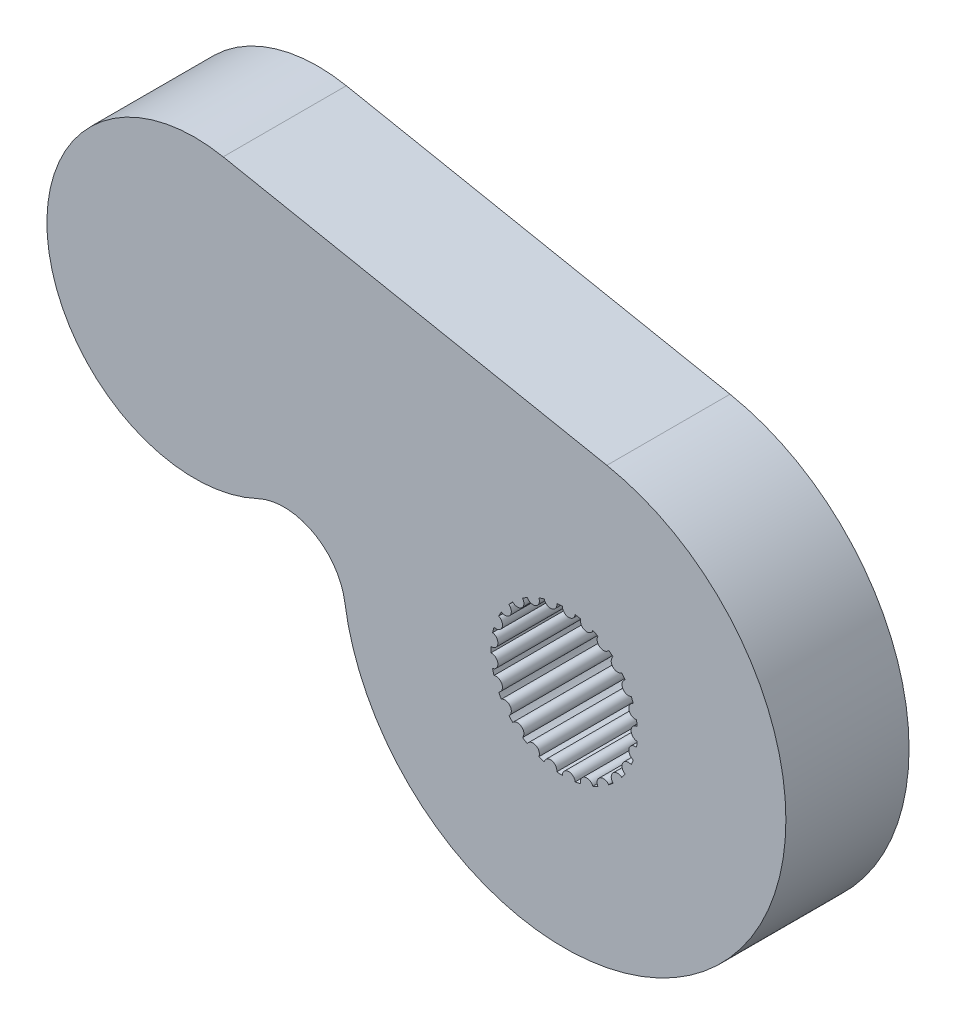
ISO-10303-21;
HEADER;
FILE_DESCRIPTION(('STEP AP214'),'2;1');
FILE_NAME('part.step','',(''),(''),'','','');
FILE_SCHEMA(('AUTOMOTIVE_DESIGN { 1 0 10303 214 1 1 1 1 }'));
ENDSEC;
DATA;
#1=APPLICATION_CONTEXT('core data for automotive mechanical design processes');
#2=APPLICATION_PROTOCOL_DEFINITION('international standard','automotive_design',2000,#1);
#3=PRODUCT_CONTEXT('',#1,'mechanical');
#4=PRODUCT('Part','Part','',(#3));
#5=PRODUCT_RELATED_PRODUCT_CATEGORY('part','',(#4));
#6=PRODUCT_DEFINITION_FORMATION('','',#4);
#7=PRODUCT_DEFINITION_CONTEXT('part definition',#1,'design');
#8=PRODUCT_DEFINITION('design','',#6,#7);
#9=PRODUCT_DEFINITION_SHAPE('','',#8);
#10=(LENGTH_UNIT() NAMED_UNIT(*) SI_UNIT(.MILLI.,.METRE.));
#11=(NAMED_UNIT(*) PLANE_ANGLE_UNIT() SI_UNIT($,.RADIAN.));
#12=(NAMED_UNIT(*) SI_UNIT($,.STERADIAN.) SOLID_ANGLE_UNIT());
#13=UNCERTAINTY_MEASURE_WITH_UNIT(LENGTH_MEASURE(1.E-05),#10,'distance_accuracy_value','');
#14=(GEOMETRIC_REPRESENTATION_CONTEXT(3) GLOBAL_UNCERTAINTY_ASSIGNED_CONTEXT((#13)) GLOBAL_UNIT_ASSIGNED_CONTEXT((#10,
#11,#12)) REPRESENTATION_CONTEXT('',''));
#15=CARTESIAN_POINT('',(0.,0.,0.));
#16=DIRECTION('',(0.,0.,1.));
#17=DIRECTION('',(1.,0.,0.));
#18=AXIS2_PLACEMENT_3D('',#15,#16,#17);
#19=CARTESIAN_POINT('',(0.,0.,5.));
#20=DIRECTION('',(0.,0.,-1.));
#21=DIRECTION('',(-1.,0.,0.));
#22=AXIS2_PLACEMENT_3D('',#19,#20,#21);
#23=CYLINDRICAL_SURFACE('',#22,2.975);
#24=DIRECTION('',(0.,0.,1.));
#25=VECTOR('',#24,1.);
#26=CARTESIAN_POINT('',(2.93512810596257,0.485435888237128,2.5));
#27=LINE('',#26,#25);
#28=CARTESIAN_POINT('',(2.93512810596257,0.485435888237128,0.));
#29=VERTEX_POINT('',#28);
#30=CARTESIAN_POINT('',(2.93512810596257,0.485435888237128,5.));
#31=VERTEX_POINT('',#30);
#32=EDGE_CURVE('E390',#29,#31,#27,.T.);
#33=ORIENTED_EDGE('',*,*,#32,.F.);
#34=CARTESIAN_POINT('',(0.,0.,0.));
#35=DIRECTION('',(0.,0.,1.));
#36=DIRECTION('',(1.,0.,0.));
#37=AXIS2_PLACEMENT_3D('',#34,#35,#36);
#38=CIRCLE('',#37,2.975);
#39=CARTESIAN_POINT('',(2.96363865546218,0.259751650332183,0.));
#40=VERTEX_POINT('',#39);
#41=EDGE_CURVE('E674',#40,#29,#38,.T.);
#42=ORIENTED_EDGE('',*,*,#41,.F.);
#43=DIRECTION('',(0.,0.,1.));
#44=VECTOR('',#43,1.);
#45=CARTESIAN_POINT('',(2.96363865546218,0.259751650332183,2.5));
#46=LINE('',#45,#44);
#47=CARTESIAN_POINT('',(2.96363865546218,0.259751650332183,5.));
#48=VERTEX_POINT('',#47);
#49=EDGE_CURVE('E706',#48,#40,#46,.F.);
#50=ORIENTED_EDGE('',*,*,#49,.F.);
#51=CARTESIAN_POINT('',(0.,0.,5.));
#52=DIRECTION('',(0.,0.,1.));
#53=DIRECTION('',(1.,0.,0.));
#54=AXIS2_PLACEMENT_3D('',#51,#52,#53);
#55=CIRCLE('',#54,2.975);
#56=EDGE_CURVE('E48',#48,#31,#55,.T.);
#57=ORIENTED_EDGE('',*,*,#56,.T.);
#58=EDGE_LOOP('',(#33,#42,#50,#57));
#59=FACE_BOUND('',#58,.T.);
#60=ADVANCED_FACE('F33',(#59),#23,.F.);
#61=DIRECTION('',(0.,0.,1.));
#62=VECTOR('',#61,1.);
#63=CARTESIAN_POINT('',(2.80593288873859,0.98861803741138,2.5));
#64=LINE('',#63,#62);
#65=CARTESIAN_POINT('',(2.80593288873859,0.98861803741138,5.));
#66=VERTEX_POINT('',#65);
#67=CARTESIAN_POINT('',(2.80593288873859,0.98861803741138,0.));
#68=VERTEX_POINT('',#67);
#69=EDGE_CURVE('E385',#66,#68,#64,.F.);
#70=ORIENTED_EDGE('',*,*,#69,.F.);
#71=CARTESIAN_POINT('',(2.72219266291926,1.20012170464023,5.));
#72=VERTEX_POINT('',#71);
#73=EDGE_CURVE('E375',#66,#72,#55,.T.);
#74=ORIENTED_EDGE('',*,*,#73,.T.);
#75=DIRECTION('',(0.,0.,1.));
#76=VECTOR('',#75,1.);
#77=CARTESIAN_POINT('',(2.72219266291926,1.20012170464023,2.5));
#78=LINE('',#77,#76);
#79=CARTESIAN_POINT('',(2.72219266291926,1.20012170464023,0.));
#80=VERTEX_POINT('',#79);
#81=EDGE_CURVE('E405',#80,#72,#78,.T.);
#82=ORIENTED_EDGE('',*,*,#81,.F.);
#83=EDGE_CURVE('E56',#68,#80,#38,.T.);
#84=ORIENTED_EDGE('',*,*,#83,.F.);
#85=EDGE_LOOP('',(#70,#74,#82,#84));
#86=FACE_BOUND('',#85,.T.);
#87=ADVANCED_FACE('F386',(#86),#23,.F.);
#88=DIRECTION('',(0.,0.,1.));
#89=VECTOR('',#88,1.);
#90=CARTESIAN_POINT('',(2.47192003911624,1.65536591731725,2.5));
#91=LINE('',#90,#89);
#92=CARTESIAN_POINT('',(2.47192003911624,1.65536591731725,5.));
#93=VERTEX_POINT('',#92);
#94=CARTESIAN_POINT('',(2.47192003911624,1.65536591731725,0.));
#95=VERTEX_POINT('',#94);
#96=EDGE_CURVE('E401',#93,#95,#91,.F.);
#97=ORIENTED_EDGE('',*,*,#96,.F.);
#98=CARTESIAN_POINT('',(2.33821184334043,1.8393994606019,5.));
#99=VERTEX_POINT('',#98);
#100=EDGE_CURVE('E383',#93,#99,#55,.T.);
#101=ORIENTED_EDGE('',*,*,#100,.T.);
#102=DIRECTION('',(0.,0.,1.));
#103=VECTOR('',#102,1.);
#104=CARTESIAN_POINT('',(2.33821184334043,1.8393994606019,2.5));
#105=LINE('',#104,#103);
#106=CARTESIAN_POINT('',(2.33821184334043,1.8393994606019,0.));
#107=VERTEX_POINT('',#106);
#108=EDGE_CURVE('E416',#107,#99,#105,.T.);
#109=ORIENTED_EDGE('',*,*,#108,.F.);
#110=EDGE_CURVE('E824',#95,#107,#38,.T.);
#111=ORIENTED_EDGE('',*,*,#110,.F.);
#112=EDGE_LOOP('',(#97,#101,#109,#111));
#113=FACE_BOUND('',#112,.T.);
#114=ADVANCED_FACE('F814',(#113),#23,.F.);
#115=DIRECTION('',(0.,0.,1.));
#116=VECTOR('',#115,1.);
#117=CARTESIAN_POINT('',(1.98258736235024,2.2181010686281,2.5));
#118=LINE('',#117,#116);
#119=CARTESIAN_POINT('',(1.98258736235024,2.2181010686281,5.));
#120=VERTEX_POINT('',#119);
#121=CARTESIAN_POINT('',(1.98258736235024,2.2181010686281,0.));
#122=VERTEX_POINT('',#121);
#123=EDGE_CURVE('E411',#120,#122,#118,.F.);
#124=ORIENTED_EDGE('',*,*,#123,.F.);
#125=CARTESIAN_POINT('',(1.80731257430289,2.36310098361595,5.));
#126=VERTEX_POINT('',#125);
#127=EDGE_CURVE('E804',#120,#126,#55,.T.);
#128=ORIENTED_EDGE('',*,*,#127,.T.);
#129=DIRECTION('',(0.,0.,1.));
#130=VECTOR('',#129,1.);
#131=CARTESIAN_POINT('',(1.80731257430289,2.36310098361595,2.5));
#132=LINE('',#131,#130);
#133=CARTESIAN_POINT('',(1.80731257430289,2.36310098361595,0.));
#134=VERTEX_POINT('',#133);
#135=EDGE_CURVE('E428',#134,#126,#132,.T.);
#136=ORIENTED_EDGE('',*,*,#135,.F.);
#137=EDGE_CURVE('E821',#122,#134,#38,.T.);
#138=ORIENTED_EDGE('',*,*,#137,.F.);
#139=EDGE_LOOP('',(#124,#128,#136,#138));
#140=FACE_BOUND('',#139,.T.);
#141=ADVANCED_FACE('F820',(#140),#23,.F.);
#142=DIRECTION('',(0.,0.,1.));
#143=VECTOR('',#142,1.);
#144=CARTESIAN_POINT('',(1.3686814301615,2.64146477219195,2.5));
#145=LINE('',#144,#143);
#146=CARTESIAN_POINT('',(1.3686814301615,2.64146477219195,5.));
#147=VERTEX_POINT('',#146);
#148=CARTESIAN_POINT('',(1.3686814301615,2.64146477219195,0.));
#149=VERTEX_POINT('',#148);
#150=EDGE_CURVE('E423',#147,#149,#145,.F.);
#151=ORIENTED_EDGE('',*,*,#150,.F.);
#152=CARTESIAN_POINT('',(1.16285320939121,2.73832018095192,5.));
#153=VERTEX_POINT('',#152);
#154=EDGE_CURVE('E800',#147,#153,#55,.T.);
#155=ORIENTED_EDGE('',*,*,#154,.T.);
#156=DIRECTION('',(0.,0.,1.));
#157=VECTOR('',#156,1.);
#158=CARTESIAN_POINT('',(1.16285320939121,2.73832018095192,2.5));
#159=LINE('',#158,#157);
#160=CARTESIAN_POINT('',(1.16285320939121,2.73832018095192,0.));
#161=VERTEX_POINT('',#160);
#162=EDGE_CURVE('E440',#161,#153,#159,.T.);
#163=ORIENTED_EDGE('',*,*,#162,.F.);
#164=EDGE_CURVE('E825',#149,#161,#38,.T.);
#165=ORIENTED_EDGE('',*,*,#164,.F.);
#166=EDGE_LOOP('',(#151,#155,#163,#165));
#167=FACE_BOUND('',#166,.T.);
#168=ADVANCED_FACE('F936',(#167),#23,.F.);
#169=DIRECTION('',(0.,0.,1.));
#170=VECTOR('',#169,1.);
#171=CARTESIAN_POINT('',(0.668776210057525,2.89885552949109,2.5));
#172=LINE('',#171,#170);
#173=CARTESIAN_POINT('',(0.668776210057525,2.89885552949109,5.));
#174=VERTEX_POINT('',#173);
#175=CARTESIAN_POINT('',(0.668776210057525,2.89885552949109,0.));
#176=VERTEX_POINT('',#175);
#177=EDGE_CURVE('E435',#174,#176,#172,.F.);
#178=ORIENTED_EDGE('',*,*,#177,.F.);
#179=CARTESIAN_POINT('',(0.445327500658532,2.94148065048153,5.));
#180=VERTEX_POINT('',#179);
#181=EDGE_CURVE('E796',#174,#180,#55,.T.);
#182=ORIENTED_EDGE('',*,*,#181,.T.);
#183=DIRECTION('',(0.,0.,1.));
#184=VECTOR('',#183,1.);
#185=CARTESIAN_POINT('',(0.445327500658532,2.94148065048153,2.5));
#186=LINE('',#185,#184);
#187=CARTESIAN_POINT('',(0.445327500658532,2.94148065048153,0.));
#188=VERTEX_POINT('',#187);
#189=EDGE_CURVE('E452',#188,#180,#186,.T.);
#190=ORIENTED_EDGE('',*,*,#189,.F.);
#191=EDGE_CURVE('E826',#176,#188,#38,.T.);
#192=ORIENTED_EDGE('',*,*,#191,.F.);
#193=EDGE_LOOP('',(#178,#182,#190,#192));
#194=FACE_BOUND('',#193,.T.);
#195=ADVANCED_FACE('F932',(#194),#23,.F.);
#196=DIRECTION('',(0.,0.,1.));
#197=VECTOR('',#196,1.);
#198=CARTESIAN_POINT('',(-0.0731506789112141,2.97410053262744,2.5));
#199=LINE('',#198,#197);
#200=CARTESIAN_POINT('',(-0.0731506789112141,2.97410053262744,5.));
#201=VERTEX_POINT('',#200);
#202=CARTESIAN_POINT('',(-0.0731506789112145,2.97410053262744,0.));
#203=VERTEX_POINT('',#202);
#204=EDGE_CURVE('E447',#201,#203,#199,.F.);
#205=ORIENTED_EDGE('',*,*,#204,.F.);
#206=CARTESIAN_POINT('',(-0.300179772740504,2.95981707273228,5.));
#207=VERTEX_POINT('',#206);
#208=EDGE_CURVE('E792',#201,#207,#55,.T.);
#209=ORIENTED_EDGE('',*,*,#208,.T.);
#210=DIRECTION('',(0.,0.,1.));
#211=VECTOR('',#210,1.);
#212=CARTESIAN_POINT('',(-0.300179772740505,2.95981707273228,2.5));
#213=LINE('',#212,#211);
#214=CARTESIAN_POINT('',(-0.300179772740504,2.95981707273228,0.));
#215=VERTEX_POINT('',#214);
#216=EDGE_CURVE('E464',#215,#207,#213,.T.);
#217=ORIENTED_EDGE('',*,*,#216,.F.);
#218=EDGE_CURVE('E828',#203,#215,#38,.T.);
#219=ORIENTED_EDGE('',*,*,#218,.F.);
#220=EDGE_LOOP('',(#205,#209,#217,#219));
#221=FACE_BOUND('',#220,.T.);
#222=ADVANCED_FACE('F929',(#221),#23,.F.);
#223=DIRECTION('',(0.,0.,1.));
#224=VECTOR('',#223,1.);
#225=CARTESIAN_POINT('',(-0.810481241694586,2.86247186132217,2.5));
#226=LINE('',#225,#224);
#227=CARTESIAN_POINT('',(-0.810481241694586,2.86247186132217,5.));
#228=VERTEX_POINT('',#227);
#229=CARTESIAN_POINT('',(-0.810481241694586,2.86247186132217,0.));
#230=VERTEX_POINT('',#229);
#231=EDGE_CURVE('E459',#228,#230,#226,.F.);
#232=ORIENTED_EDGE('',*,*,#231,.F.);
#233=CARTESIAN_POINT('',(-1.02682564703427,2.79217730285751,5.));
#234=VERTEX_POINT('',#233);
#235=EDGE_CURVE('E788',#228,#234,#55,.T.);
#236=ORIENTED_EDGE('',*,*,#235,.T.);
#237=DIRECTION('',(0.,0.,1.));
#238=VECTOR('',#237,1.);
#239=CARTESIAN_POINT('',(-1.02682564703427,2.79217730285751,2.5));
#240=LINE('',#239,#238);
#241=CARTESIAN_POINT('',(-1.02682564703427,2.79217730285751,0.));
#242=VERTEX_POINT('',#241);
#243=EDGE_CURVE('E476',#242,#234,#240,.T.);
#244=ORIENTED_EDGE('',*,*,#243,.F.);
#245=EDGE_CURVE('E830',#230,#242,#38,.T.);
#246=ORIENTED_EDGE('',*,*,#245,.F.);
#247=EDGE_LOOP('',(#232,#236,#244,#246));
#248=FACE_BOUND('',#247,.T.);
#249=ADVANCED_FACE('F924',(#248),#23,.F.);
#250=DIRECTION('',(0.,0.,1.));
#251=VECTOR('',#250,1.);
#252=CARTESIAN_POINT('',(-1.49688628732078,2.57098355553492,2.5));
#253=LINE('',#252,#251);
#254=CARTESIAN_POINT('',(-1.49688628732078,2.57098355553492,5.));
#255=VERTEX_POINT('',#254);
#256=CARTESIAN_POINT('',(-1.49688628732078,2.57098355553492,0.));
#257=VERTEX_POINT('',#256);
#258=EDGE_CURVE('E471',#255,#257,#253,.F.);
#259=ORIENTED_EDGE('',*,*,#258,.F.);
#260=CARTESIAN_POINT('',(-1.68895228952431,2.44909476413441,5.));
#261=VERTEX_POINT('',#260);
#262=EDGE_CURVE('E784',#255,#261,#55,.T.);
#263=ORIENTED_EDGE('',*,*,#262,.T.);
#264=DIRECTION('',(0.,0.,1.));
#265=VECTOR('',#264,1.);
#266=CARTESIAN_POINT('',(-1.68895228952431,2.44909476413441,2.5));
#267=LINE('',#266,#265);
#268=CARTESIAN_POINT('',(-1.68895228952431,2.44909476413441,0.));
#269=VERTEX_POINT('',#268);
#270=EDGE_CURVE('E488',#269,#261,#267,.T.);
#271=ORIENTED_EDGE('',*,*,#270,.F.);
#272=EDGE_CURVE('E832',#257,#269,#38,.T.);
#273=ORIENTED_EDGE('',*,*,#272,.F.);
#274=EDGE_LOOP('',(#259,#263,#271,#273));
#275=FACE_BOUND('',#274,.T.);
#276=ADVANCED_FACE('F921',(#275),#23,.F.);
#277=DIRECTION('',(0.,0.,1.));
#278=VECTOR('',#277,1.);
#279=CARTESIAN_POINT('',(-2.08923646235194,2.11795089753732,2.5));
#280=LINE('',#279,#278);
#281=CARTESIAN_POINT('',(-2.08923646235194,2.11795089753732,5.));
#282=VERTEX_POINT('',#281);
#283=CARTESIAN_POINT('',(-2.08923646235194,2.11795089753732,0.));
#284=VERTEX_POINT('',#283);
#285=EDGE_CURVE('E483',#282,#284,#280,.F.);
#286=ORIENTED_EDGE('',*,*,#285,.F.);
#287=CARTESIAN_POINT('',(-2.24495584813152,1.95212659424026,5.));
#288=VERTEX_POINT('',#287);
#289=EDGE_CURVE('E780',#282,#288,#55,.T.);
#290=ORIENTED_EDGE('',*,*,#289,.T.);
#291=DIRECTION('',(0.,0.,1.));
#292=VECTOR('',#291,1.);
#293=CARTESIAN_POINT('',(-2.24495584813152,1.95212659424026,2.5));
#294=LINE('',#293,#292);
#295=CARTESIAN_POINT('',(-2.24495584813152,1.95212659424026,0.));
#296=VERTEX_POINT('',#295);
#297=EDGE_CURVE('E500',#296,#288,#294,.T.);
#298=ORIENTED_EDGE('',*,*,#297,.F.);
#299=EDGE_CURVE('E834',#284,#296,#38,.T.);
#300=ORIENTED_EDGE('',*,*,#299,.F.);
#301=EDGE_LOOP('',(#286,#290,#298,#300));
#302=FACE_BOUND('',#301,.T.);
#303=ADVANCED_FACE('F916',(#302),#23,.F.);
#304=DIRECTION('',(0.,0.,1.));
#305=VECTOR('',#304,1.);
#306=CARTESIAN_POINT('',(-2.5503122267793,1.53183959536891,2.5));
#307=LINE('',#306,#305);
#308=CARTESIAN_POINT('',(-2.5503122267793,1.53183959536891,5.));
#309=VERTEX_POINT('',#308);
#310=CARTESIAN_POINT('',(-2.5503122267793,1.53183959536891,0.));
#311=VERTEX_POINT('',#310);
#312=EDGE_CURVE('E495',#309,#311,#307,.F.);
#313=ORIENTED_EDGE('',*,*,#312,.F.);
#314=CARTESIAN_POINT('',(-2.65990057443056,1.33249913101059,5.));
#315=VERTEX_POINT('',#314);
#316=EDGE_CURVE('E776',#309,#315,#55,.T.);
#317=ORIENTED_EDGE('',*,*,#316,.T.);
#318=DIRECTION('',(0.,0.,1.));
#319=VECTOR('',#318,1.);
#320=CARTESIAN_POINT('',(-2.65990057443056,1.33249913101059,2.5));
#321=LINE('',#320,#319);
#322=CARTESIAN_POINT('',(-2.65990057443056,1.33249913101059,0.));
#323=VERTEX_POINT('',#322);
#324=EDGE_CURVE('E512',#323,#315,#321,.T.);
#325=ORIENTED_EDGE('',*,*,#324,.F.);
#326=EDGE_CURVE('E836',#311,#323,#38,.T.);
#327=ORIENTED_EDGE('',*,*,#326,.F.);
#328=EDGE_LOOP('',(#313,#317,#325,#327));
#329=FACE_BOUND('',#328,.T.);
#330=ADVANCED_FACE('F913',(#329),#23,.F.);
#331=DIRECTION('',(0.,0.,1.));
#332=VECTOR('',#331,1.);
#333=CARTESIAN_POINT('',(-2.85114249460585,0.849477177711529,2.5));
#334=LINE('',#333,#332);
#335=CARTESIAN_POINT('',(-2.85114249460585,0.849477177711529,5.));
#336=VERTEX_POINT('',#335);
#337=CARTESIAN_POINT('',(-2.85114249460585,0.849477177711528,0.));
#338=VERTEX_POINT('',#337);
#339=EDGE_CURVE('E507',#336,#338,#334,.F.);
#340=ORIENTED_EDGE('',*,*,#339,.F.);
#341=CARTESIAN_POINT('',(-2.9077139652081,0.629145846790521,5.));
#342=VERTEX_POINT('',#341);
#343=EDGE_CURVE('E772',#336,#342,#55,.T.);
#344=ORIENTED_EDGE('',*,*,#343,.T.);
#345=DIRECTION('',(0.,0.,1.));
#346=VECTOR('',#345,1.);
#347=CARTESIAN_POINT('',(-2.9077139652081,0.62914584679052,2.5));
#348=LINE('',#347,#346);
#349=CARTESIAN_POINT('',(-2.9077139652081,0.629145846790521,0.));
#350=VERTEX_POINT('',#349);
#351=EDGE_CURVE('E524',#350,#342,#348,.T.);
#352=ORIENTED_EDGE('',*,*,#351,.F.);
#353=EDGE_CURVE('E838',#338,#350,#38,.T.);
#354=ORIENTED_EDGE('',*,*,#353,.F.);
#355=EDGE_LOOP('',(#340,#344,#352,#354));
#356=FACE_BOUND('',#355,.T.);
#357=ADVANCED_FACE('F908',(#356),#23,.F.);
#358=DIRECTION('',(0.,0.,1.));
#359=VECTOR('',#358,1.);
#360=CARTESIAN_POINT('',(-2.9728249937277,0.113738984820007,2.5));
#361=LINE('',#360,#359);
#362=CARTESIAN_POINT('',(-2.9728249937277,0.113738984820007,5.));
#363=VERTEX_POINT('',#362);
#364=CARTESIAN_POINT('',(-2.9728249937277,0.113738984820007,0.));
#365=VERTEX_POINT('',#364);
#366=EDGE_CURVE('E519',#363,#365,#361,.F.);
#367=ORIENTED_EDGE('',*,*,#366,.F.);
#368=CARTESIAN_POINT('',(-2.97282499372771,-0.113738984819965,5.));
#369=VERTEX_POINT('',#368);
#370=EDGE_CURVE('E768',#363,#369,#55,.T.);
#371=ORIENTED_EDGE('',*,*,#370,.T.);
#372=DIRECTION('',(0.,0.,1.));
#373=VECTOR('',#372,1.);
#374=CARTESIAN_POINT('',(-2.97282499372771,-0.113738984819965,2.5));
#375=LINE('',#374,#373);
#376=CARTESIAN_POINT('',(-2.97282499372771,-0.113738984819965,0.));
#377=VERTEX_POINT('',#376);
#378=EDGE_CURVE('E536',#377,#369,#375,.T.);
#379=ORIENTED_EDGE('',*,*,#378,.F.);
#380=EDGE_CURVE('E840',#365,#377,#38,.T.);
#381=ORIENTED_EDGE('',*,*,#380,.F.);
#382=EDGE_LOOP('',(#367,#371,#379,#381));
#383=FACE_BOUND('',#382,.T.);
#384=ADVANCED_FACE('F905',(#383),#23,.F.);
#385=DIRECTION('',(0.,0.,1.));
#386=VECTOR('',#385,1.);
#387=CARTESIAN_POINT('',(-2.90771396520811,-0.62914584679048,2.5));
#388=LINE('',#387,#386);
#389=CARTESIAN_POINT('',(-2.90771396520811,-0.62914584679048,5.));
#390=VERTEX_POINT('',#389);
#391=CARTESIAN_POINT('',(-2.90771396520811,-0.62914584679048,0.));
#392=VERTEX_POINT('',#391);
#393=EDGE_CURVE('E531',#390,#392,#388,.F.);
#394=ORIENTED_EDGE('',*,*,#393,.F.);
#395=CARTESIAN_POINT('',(-2.85114249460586,-0.849477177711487,5.));
#396=VERTEX_POINT('',#395);
#397=EDGE_CURVE('E764',#390,#396,#55,.T.);
#398=ORIENTED_EDGE('',*,*,#397,.T.);
#399=DIRECTION('',(0.,0.,1.));
#400=VECTOR('',#399,1.);
#401=CARTESIAN_POINT('',(-2.85114249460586,-0.849477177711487,2.5));
#402=LINE('',#401,#400);
#403=CARTESIAN_POINT('',(-2.85114249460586,-0.849477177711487,0.));
#404=VERTEX_POINT('',#403);
#405=EDGE_CURVE('E548',#404,#396,#402,.T.);
#406=ORIENTED_EDGE('',*,*,#405,.F.);
#407=EDGE_CURVE('E842',#392,#404,#38,.T.);
#408=ORIENTED_EDGE('',*,*,#407,.F.);
#409=EDGE_LOOP('',(#394,#398,#406,#408));
#410=FACE_BOUND('',#409,.T.);
#411=ADVANCED_FACE('F900',(#410),#23,.F.);
#412=DIRECTION('',(0.,0.,1.));
#413=VECTOR('',#412,1.);
#414=CARTESIAN_POINT('',(-2.65990057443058,-1.33249913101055,2.5));
#415=LINE('',#414,#413);
#416=CARTESIAN_POINT('',(-2.65990057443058,-1.33249913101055,5.));
#417=VERTEX_POINT('',#416);
#418=CARTESIAN_POINT('',(-2.65990057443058,-1.33249913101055,0.));
#419=VERTEX_POINT('',#418);
#420=EDGE_CURVE('E543',#417,#419,#415,.F.);
#421=ORIENTED_EDGE('',*,*,#420,.F.);
#422=CARTESIAN_POINT('',(-2.55031222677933,-1.53183959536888,5.));
#423=VERTEX_POINT('',#422);
#424=EDGE_CURVE('E760',#417,#423,#55,.T.);
#425=ORIENTED_EDGE('',*,*,#424,.T.);
#426=DIRECTION('',(0.,0.,1.));
#427=VECTOR('',#426,1.);
#428=CARTESIAN_POINT('',(-2.55031222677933,-1.53183959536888,2.5));
#429=LINE('',#428,#427);
#430=CARTESIAN_POINT('',(-2.55031222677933,-1.53183959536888,0.));
#431=VERTEX_POINT('',#430);
#432=EDGE_CURVE('E560',#431,#423,#429,.T.);
#433=ORIENTED_EDGE('',*,*,#432,.F.);
#434=EDGE_CURVE('E844',#419,#431,#38,.T.);
#435=ORIENTED_EDGE('',*,*,#434,.F.);
#436=EDGE_LOOP('',(#421,#425,#433,#435));
#437=FACE_BOUND('',#436,.T.);
#438=ADVANCED_FACE('F897',(#437),#23,.F.);
#439=DIRECTION('',(0.,0.,1.));
#440=VECTOR('',#439,1.);
#441=CARTESIAN_POINT('',(-2.24495584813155,-1.95212659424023,2.5));
#442=LINE('',#441,#440);
#443=CARTESIAN_POINT('',(-2.24495584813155,-1.95212659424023,5.));
#444=VERTEX_POINT('',#443);
#445=CARTESIAN_POINT('',(-2.24495584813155,-1.95212659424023,0.));
#446=VERTEX_POINT('',#445);
#447=EDGE_CURVE('E555',#444,#446,#442,.F.);
#448=ORIENTED_EDGE('',*,*,#447,.F.);
#449=CARTESIAN_POINT('',(-2.08923646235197,-2.11795089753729,5.));
#450=VERTEX_POINT('',#449);
#451=EDGE_CURVE('E756',#444,#450,#55,.T.);
#452=ORIENTED_EDGE('',*,*,#451,.T.);
#453=DIRECTION('',(0.,0.,1.));
#454=VECTOR('',#453,1.);
#455=CARTESIAN_POINT('',(-2.08923646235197,-2.11795089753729,2.5));
#456=LINE('',#455,#454);
#457=CARTESIAN_POINT('',(-2.08923646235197,-2.11795089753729,0.));
#458=VERTEX_POINT('',#457);
#459=EDGE_CURVE('E572',#458,#450,#456,.T.);
#460=ORIENTED_EDGE('',*,*,#459,.F.);
#461=EDGE_CURVE('E846',#446,#458,#38,.T.);
#462=ORIENTED_EDGE('',*,*,#461,.F.);
#463=EDGE_LOOP('',(#448,#452,#460,#462));
#464=FACE_BOUND('',#463,.T.);
#465=ADVANCED_FACE('F892',(#464),#23,.F.);
#466=DIRECTION('',(0.,0.,1.));
#467=VECTOR('',#466,1.);
#468=CARTESIAN_POINT('',(-1.68895228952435,-2.44909476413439,2.5));
#469=LINE('',#468,#467);
#470=CARTESIAN_POINT('',(-1.68895228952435,-2.44909476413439,5.));
#471=VERTEX_POINT('',#470);
#472=CARTESIAN_POINT('',(-1.68895228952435,-2.44909476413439,0.));
#473=VERTEX_POINT('',#472);
#474=EDGE_CURVE('E567',#471,#473,#469,.F.);
#475=ORIENTED_EDGE('',*,*,#474,.F.);
#476=CARTESIAN_POINT('',(-1.49688628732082,-2.5709835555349,5.));
#477=VERTEX_POINT('',#476);
#478=EDGE_CURVE('E752',#471,#477,#55,.T.);
#479=ORIENTED_EDGE('',*,*,#478,.T.);
#480=DIRECTION('',(0.,0.,1.));
#481=VECTOR('',#480,1.);
#482=CARTESIAN_POINT('',(-1.49688628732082,-2.5709835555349,2.5));
#483=LINE('',#482,#481);
#484=CARTESIAN_POINT('',(-1.49688628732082,-2.5709835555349,0.));
#485=VERTEX_POINT('',#484);
#486=EDGE_CURVE('E584',#485,#477,#483,.T.);
#487=ORIENTED_EDGE('',*,*,#486,.F.);
#488=EDGE_CURVE('E848',#473,#485,#38,.T.);
#489=ORIENTED_EDGE('',*,*,#488,.F.);
#490=EDGE_LOOP('',(#475,#479,#487,#489));
#491=FACE_BOUND('',#490,.T.);
#492=ADVANCED_FACE('F889',(#491),#23,.F.);
#493=DIRECTION('',(0.,0.,1.));
#494=VECTOR('',#493,1.);
#495=CARTESIAN_POINT('',(-1.02682564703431,-2.7921773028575,2.5));
#496=LINE('',#495,#494);
#497=CARTESIAN_POINT('',(-1.02682564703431,-2.7921773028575,5.));
#498=VERTEX_POINT('',#497);
#499=CARTESIAN_POINT('',(-1.02682564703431,-2.7921773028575,0.));
#500=VERTEX_POINT('',#499);
#501=EDGE_CURVE('E579',#498,#500,#496,.F.);
#502=ORIENTED_EDGE('',*,*,#501,.F.);
#503=CARTESIAN_POINT('',(-0.810481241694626,-2.86247186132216,5.));
#504=VERTEX_POINT('',#503);
#505=EDGE_CURVE('E748',#498,#504,#55,.T.);
#506=ORIENTED_EDGE('',*,*,#505,.T.);
#507=DIRECTION('',(0.,0.,1.));
#508=VECTOR('',#507,1.);
#509=CARTESIAN_POINT('',(-0.810481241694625,-2.86247186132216,2.5));
#510=LINE('',#509,#508);
#511=CARTESIAN_POINT('',(-0.810481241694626,-2.86247186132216,0.));
#512=VERTEX_POINT('',#511);
#513=EDGE_CURVE('E596',#512,#504,#510,.T.);
#514=ORIENTED_EDGE('',*,*,#513,.F.);
#515=EDGE_CURVE('E850',#500,#512,#38,.T.);
#516=ORIENTED_EDGE('',*,*,#515,.F.);
#517=EDGE_LOOP('',(#502,#506,#514,#516));
#518=FACE_BOUND('',#517,.T.);
#519=ADVANCED_FACE('F884',(#518),#23,.F.);
#520=DIRECTION('',(0.,0.,1.));
#521=VECTOR('',#520,1.);
#522=CARTESIAN_POINT('',(-0.300179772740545,-2.95981707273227,2.5));
#523=LINE('',#522,#521);
#524=CARTESIAN_POINT('',(-0.300179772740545,-2.95981707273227,5.));
#525=VERTEX_POINT('',#524);
#526=CARTESIAN_POINT('',(-0.300179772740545,-2.95981707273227,0.));
#527=VERTEX_POINT('',#526);
#528=EDGE_CURVE('E591',#525,#527,#523,.F.);
#529=ORIENTED_EDGE('',*,*,#528,.F.);
#530=CARTESIAN_POINT('',(-0.0731506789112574,-2.97410053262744,5.));
#531=VERTEX_POINT('',#530);
#532=EDGE_CURVE('E744',#525,#531,#55,.T.);
#533=ORIENTED_EDGE('',*,*,#532,.T.);
#534=DIRECTION('',(0.,0.,1.));
#535=VECTOR('',#534,1.);
#536=CARTESIAN_POINT('',(-0.0731506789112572,-2.97410053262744,2.5));
#537=LINE('',#536,#535);
#538=CARTESIAN_POINT('',(-0.0731506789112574,-2.97410053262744,0.));
#539=VERTEX_POINT('',#538);
#540=EDGE_CURVE('E608',#539,#531,#537,.T.);
#541=ORIENTED_EDGE('',*,*,#540,.F.);
#542=EDGE_CURVE('E852',#527,#539,#38,.T.);
#543=ORIENTED_EDGE('',*,*,#542,.F.);
#544=EDGE_LOOP('',(#529,#533,#541,#543));
#545=FACE_BOUND('',#544,.T.);
#546=ADVANCED_FACE('F881',(#545),#23,.F.);
#547=DIRECTION('',(0.,0.,1.));
#548=VECTOR('',#547,1.);
#549=CARTESIAN_POINT('',(0.44532750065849,-2.94148065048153,2.5));
#550=LINE('',#549,#548);
#551=CARTESIAN_POINT('',(0.44532750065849,-2.94148065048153,5.));
#552=VERTEX_POINT('',#551);
#553=CARTESIAN_POINT('',(0.44532750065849,-2.94148065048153,0.));
#554=VERTEX_POINT('',#553);
#555=EDGE_CURVE('E603',#552,#554,#550,.F.);
#556=ORIENTED_EDGE('',*,*,#555,.F.);
#557=CARTESIAN_POINT('',(0.668776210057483,-2.8988555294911,5.));
#558=VERTEX_POINT('',#557);
#559=EDGE_CURVE('E740',#552,#558,#55,.T.);
#560=ORIENTED_EDGE('',*,*,#559,.T.);
#561=DIRECTION('',(0.,0.,1.));
#562=VECTOR('',#561,1.);
#563=CARTESIAN_POINT('',(0.668776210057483,-2.8988555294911,2.5));
#564=LINE('',#563,#562);
#565=CARTESIAN_POINT('',(0.668776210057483,-2.8988555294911,0.));
#566=VERTEX_POINT('',#565);
#567=EDGE_CURVE('E620',#566,#558,#564,.T.);
#568=ORIENTED_EDGE('',*,*,#567,.F.);
#569=EDGE_CURVE('E854',#554,#566,#38,.T.);
#570=ORIENTED_EDGE('',*,*,#569,.F.);
#571=EDGE_LOOP('',(#556,#560,#568,#570));
#572=FACE_BOUND('',#571,.T.);
#573=ADVANCED_FACE('F876',(#572),#23,.F.);
#574=DIRECTION('',(0.,0.,1.));
#575=VECTOR('',#574,1.);
#576=CARTESIAN_POINT('',(1.16285320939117,-2.73832018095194,2.5));
#577=LINE('',#576,#575);
#578=CARTESIAN_POINT('',(1.16285320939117,-2.73832018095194,5.));
#579=VERTEX_POINT('',#578);
#580=CARTESIAN_POINT('',(1.16285320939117,-2.73832018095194,0.));
#581=VERTEX_POINT('',#580);
#582=EDGE_CURVE('E615',#579,#581,#577,.F.);
#583=ORIENTED_EDGE('',*,*,#582,.F.);
#584=CARTESIAN_POINT('',(1.36868143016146,-2.64146477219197,5.));
#585=VERTEX_POINT('',#584);
#586=EDGE_CURVE('E736',#579,#585,#55,.T.);
#587=ORIENTED_EDGE('',*,*,#586,.T.);
#588=DIRECTION('',(0.,0.,1.));
#589=VECTOR('',#588,1.);
#590=CARTESIAN_POINT('',(1.36868143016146,-2.64146477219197,2.5));
#591=LINE('',#590,#589);
#592=CARTESIAN_POINT('',(1.36868143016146,-2.64146477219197,0.));
#593=VERTEX_POINT('',#592);
#594=EDGE_CURVE('E632',#593,#585,#591,.T.);
#595=ORIENTED_EDGE('',*,*,#594,.F.);
#596=EDGE_CURVE('E856',#581,#593,#38,.T.);
#597=ORIENTED_EDGE('',*,*,#596,.F.);
#598=EDGE_LOOP('',(#583,#587,#595,#597));
#599=FACE_BOUND('',#598,.T.);
#600=ADVANCED_FACE('F873',(#599),#23,.F.);
#601=DIRECTION('',(0.,0.,1.));
#602=VECTOR('',#601,1.);
#603=CARTESIAN_POINT('',(1.80731257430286,-2.36310098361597,2.5));
#604=LINE('',#603,#602);
#605=CARTESIAN_POINT('',(1.80731257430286,-2.36310098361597,5.));
#606=VERTEX_POINT('',#605);
#607=CARTESIAN_POINT('',(1.80731257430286,-2.36310098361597,0.));
#608=VERTEX_POINT('',#607);
#609=EDGE_CURVE('E627',#606,#608,#604,.F.);
#610=ORIENTED_EDGE('',*,*,#609,.F.);
#611=CARTESIAN_POINT('',(1.98258736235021,-2.21810106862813,5.));
#612=VERTEX_POINT('',#611);
#613=EDGE_CURVE('E732',#606,#612,#55,.T.);
#614=ORIENTED_EDGE('',*,*,#613,.T.);
#615=DIRECTION('',(0.,0.,1.));
#616=VECTOR('',#615,1.);
#617=CARTESIAN_POINT('',(1.98258736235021,-2.21810106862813,2.5));
#618=LINE('',#617,#616);
#619=CARTESIAN_POINT('',(1.98258736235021,-2.21810106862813,0.));
#620=VERTEX_POINT('',#619);
#621=EDGE_CURVE('E644',#620,#612,#618,.T.);
#622=ORIENTED_EDGE('',*,*,#621,.F.);
#623=EDGE_CURVE('E858',#608,#620,#38,.T.);
#624=ORIENTED_EDGE('',*,*,#623,.F.);
#625=EDGE_LOOP('',(#610,#614,#622,#624));
#626=FACE_BOUND('',#625,.T.);
#627=ADVANCED_FACE('F868',(#626),#23,.F.);
#628=DIRECTION('',(0.,0.,1.));
#629=VECTOR('',#628,1.);
#630=CARTESIAN_POINT('',(2.3382118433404,-1.83939946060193,2.5));
#631=LINE('',#630,#629);
#632=CARTESIAN_POINT('',(2.3382118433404,-1.83939946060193,5.));
#633=VERTEX_POINT('',#632);
#634=CARTESIAN_POINT('',(2.3382118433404,-1.83939946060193,0.));
#635=VERTEX_POINT('',#634);
#636=EDGE_CURVE('E639',#633,#635,#631,.F.);
#637=ORIENTED_EDGE('',*,*,#636,.F.);
#638=CARTESIAN_POINT('',(2.47192003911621,-1.65536591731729,5.));
#639=VERTEX_POINT('',#638);
#640=EDGE_CURVE('E731',#633,#639,#55,.T.);
#641=ORIENTED_EDGE('',*,*,#640,.T.);
#642=DIRECTION('',(0.,0.,1.));
#643=VECTOR('',#642,1.);
#644=CARTESIAN_POINT('',(2.47192003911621,-1.65536591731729,2.5));
#645=LINE('',#644,#643);
#646=CARTESIAN_POINT('',(2.47192003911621,-1.65536591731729,0.));
#647=VERTEX_POINT('',#646);
#648=EDGE_CURVE('E656',#647,#639,#645,.T.);
#649=ORIENTED_EDGE('',*,*,#648,.F.);
#650=EDGE_CURVE('E727',#635,#647,#38,.T.);
#651=ORIENTED_EDGE('',*,*,#650,.F.);
#652=EDGE_LOOP('',(#637,#641,#649,#651));
#653=FACE_BOUND('',#652,.T.);
#654=ADVANCED_FACE('F861',(#653),#23,.F.);
#655=DIRECTION('',(0.,0.,1.));
#656=VECTOR('',#655,1.);
#657=CARTESIAN_POINT('',(2.72219266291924,-1.20012170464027,2.5));
#658=LINE('',#657,#656);
#659=CARTESIAN_POINT('',(2.72219266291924,-1.20012170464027,5.));
#660=VERTEX_POINT('',#659);
#661=CARTESIAN_POINT('',(2.72219266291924,-1.20012170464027,0.));
#662=VERTEX_POINT('',#661);
#663=EDGE_CURVE('E651',#660,#662,#658,.F.);
#664=ORIENTED_EDGE('',*,*,#663,.F.);
#665=CARTESIAN_POINT('',(2.80593288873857,-0.98861803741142,5.));
#666=VERTEX_POINT('',#665);
#667=EDGE_CURVE('E729',#660,#666,#55,.T.);
#668=ORIENTED_EDGE('',*,*,#667,.T.);
#669=DIRECTION('',(0.,0.,1.));
#670=VECTOR('',#669,1.);
#671=CARTESIAN_POINT('',(2.80593288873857,-0.98861803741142,2.5));
#672=LINE('',#671,#670);
#673=CARTESIAN_POINT('',(2.80593288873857,-0.98861803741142,0.));
#674=VERTEX_POINT('',#673);
#675=EDGE_CURVE('E11',#674,#666,#672,.T.);
#676=ORIENTED_EDGE('',*,*,#675,.F.);
#677=EDGE_CURVE('E723',#662,#674,#38,.T.);
#678=ORIENTED_EDGE('',*,*,#677,.F.);
#679=EDGE_LOOP('',(#664,#668,#676,#678));
#680=FACE_BOUND('',#679,.T.);
#681=ADVANCED_FACE('F728',(#680),#23,.F.);
#682=CARTESIAN_POINT('',(-15.,6.,5.));
#683=DIRECTION('',(0.,0.,1.));
#684=DIRECTION('',(1.,0.,0.));
#685=AXIS2_PLACEMENT_3D('',#682,#683,#684);
#686=PLANE('',#685);
#687=ORIENTED_EDGE('',*,*,#73,.F.);
#688=CARTESIAN_POINT('',(2.88153490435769,0.739852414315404,5.));
#689=DIRECTION('',(0.,0.,1.));
#690=DIRECTION('',(1.,0.,0.));
#691=AXIS2_PLACEMENT_3D('',#688,#689,#690);
#692=CIRCLE('',#691,0.26);
#693=EDGE_CURVE('E379',#66,#31,#692,.T.);
#694=ORIENTED_EDGE('',*,*,#693,.T.);
#695=ORIENTED_EDGE('',*,*,#56,.F.);
#696=CARTESIAN_POINT('',(2.975,0.,5.));
#697=DIRECTION('',(0.,0.,1.));
#698=DIRECTION('',(1.,0.,0.));
#699=AXIS2_PLACEMENT_3D('',#696,#697,#698);
#700=CIRCLE('',#699,0.26);
#701=CARTESIAN_POINT('',(2.96363865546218,-0.259751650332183,5.));
#702=VERTEX_POINT('',#701);
#703=EDGE_CURVE('E663',#48,#702,#700,.T.);
#704=ORIENTED_EDGE('',*,*,#703,.T.);
#705=CARTESIAN_POINT('',(2.93512810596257,-0.485435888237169,5.));
#706=VERTEX_POINT('',#705);
#707=EDGE_CURVE('E673',#706,#702,#55,.T.);
#708=ORIENTED_EDGE('',*,*,#707,.F.);
#709=CARTESIAN_POINT('',(2.88153490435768,-0.739852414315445,5.));
#710=DIRECTION('',(0.,0.,1.));
#711=DIRECTION('',(1.,0.,0.));
#712=AXIS2_PLACEMENT_3D('',#709,#710,#711);
#713=CIRCLE('',#712,0.26);
#714=EDGE_CURVE('E659',#706,#666,#713,.T.);
#715=ORIENTED_EDGE('',*,*,#714,.T.);
#716=ORIENTED_EDGE('',*,*,#667,.F.);
#717=CARTESIAN_POINT('',(2.60701237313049,-1.43321718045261,5.));
#718=DIRECTION('',(0.,0.,1.));
#719=DIRECTION('',(1.,0.,0.));
#720=AXIS2_PLACEMENT_3D('',#717,#718,#719);
#721=CIRCLE('',#720,0.26);
#722=EDGE_CURVE('E647',#660,#639,#721,.T.);
#723=ORIENTED_EDGE('',*,*,#722,.T.);
#724=ORIENTED_EDGE('',*,*,#640,.F.);
#725=CARTESIAN_POINT('',(2.1686816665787,-2.03652764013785,5.));
#726=DIRECTION('',(0.,0.,1.));
#727=DIRECTION('',(1.,0.,0.));
#728=AXIS2_PLACEMENT_3D('',#725,#726,#727);
#729=CIRCLE('',#728,0.26);
#730=EDGE_CURVE('E635',#633,#612,#729,.T.);
#731=ORIENTED_EDGE('',*,*,#730,.T.);
#732=ORIENTED_EDGE('',*,*,#613,.F.);
#733=CARTESIAN_POINT('',(1.59408471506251,-2.5118755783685,5.));
#734=DIRECTION('',(0.,0.,1.));
#735=DIRECTION('',(1.,0.,0.));
#736=AXIS2_PLACEMENT_3D('',#733,#734,#735);
#737=CIRCLE('',#736,0.26);
#738=EDGE_CURVE('E623',#606,#585,#737,.T.);
#739=ORIENTED_EDGE('',*,*,#738,.T.);
#740=ORIENTED_EDGE('',*,*,#586,.F.);
#741=CARTESIAN_POINT('',(0.919325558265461,-2.82939313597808,5.));
#742=DIRECTION('',(0.,0.,1.));
#743=DIRECTION('',(1.,0.,0.));
#744=AXIS2_PLACEMENT_3D('',#741,#742,#743);
#745=CIRCLE('',#744,0.26);
#746=EDGE_CURVE('E611',#579,#558,#745,.T.);
#747=ORIENTED_EDGE('',*,*,#746,.T.);
#748=ORIENTED_EDGE('',*,*,#559,.F.);
#749=CARTESIAN_POINT('',(0.186801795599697,-2.96912951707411,5.));
#750=DIRECTION('',(0.,0.,1.));
#751=DIRECTION('',(1.,0.,0.));
#752=AXIS2_PLACEMENT_3D('',#749,#750,#751);
#753=CIRCLE('',#752,0.26);
#754=EDGE_CURVE('E599',#552,#531,#753,.T.);
#755=ORIENTED_EDGE('',*,*,#754,.T.);
#756=ORIENTED_EDGE('',*,*,#532,.F.);
#757=CARTESIAN_POINT('',(-0.557459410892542,-2.92230457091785,5.));
#758=DIRECTION('',(0.,0.,1.));
#759=DIRECTION('',(1.,0.,0.));
#760=AXIS2_PLACEMENT_3D('',#757,#758,#759);
#761=CIRCLE('',#760,0.26);
#762=EDGE_CURVE('E587',#525,#504,#761,.T.);
#763=ORIENTED_EDGE('',*,*,#762,.T.);
#764=ORIENTED_EDGE('',*,*,#505,.F.);
#765=CARTESIAN_POINT('',(-1.2666933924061,-2.6918604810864,5.));
#766=DIRECTION('',(0.,0.,1.));
#767=DIRECTION('',(1.,0.,0.));
#768=AXIS2_PLACEMENT_3D('',#765,#766,#767);
#769=CIRCLE('',#768,0.26);
#770=EDGE_CURVE('E575',#498,#477,#769,.T.);
#771=ORIENTED_EDGE('',*,*,#770,.T.);
#772=ORIENTED_EDGE('',*,*,#478,.F.);
#773=CARTESIAN_POINT('',(-1.89633636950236,-2.29227689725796,5.));
#774=DIRECTION('',(0.,0.,1.));
#775=DIRECTION('',(1.,0.,0.));
#776=AXIS2_PLACEMENT_3D('',#773,#774,#775);
#777=CIRCLE('',#776,0.259999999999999);
#778=EDGE_CURVE('E563',#471,#450,#777,.T.);
#779=ORIENTED_EDGE('',*,*,#778,.T.);
#780=ORIENTED_EDGE('',*,*,#451,.F.);
#781=CARTESIAN_POINT('',(-2.40682555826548,-1.74866112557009,5.));
#782=DIRECTION('',(0.,0.,1.));
#783=DIRECTION('',(1.,0.,0.));
#784=AXIS2_PLACEMENT_3D('',#781,#782,#783);
#785=CIRCLE('',#784,0.26);
#786=EDGE_CURVE('E551',#444,#423,#785,.T.);
#787=ORIENTED_EDGE('',*,*,#786,.T.);
#788=ORIENTED_EDGE('',*,*,#424,.F.);
#789=CARTESIAN_POINT('',(-2.76608504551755,-1.0951705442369,5.));
#790=DIRECTION('',(0.,0.,1.));
#791=DIRECTION('',(1.,0.,0.));
#792=AXIS2_PLACEMENT_3D('',#789,#790,#791);
#793=CIRCLE('',#792,0.26);
#794=EDGE_CURVE('E539',#417,#396,#793,.T.);
#795=ORIENTED_EDGE('',*,*,#794,.T.);
#796=ORIENTED_EDGE('',*,*,#397,.F.);
#797=CARTESIAN_POINT('',(-2.95154123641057,-0.372866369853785,5.));
#798=DIRECTION('',(0.,0.,1.));
#799=DIRECTION('',(1.,0.,0.));
#800=AXIS2_PLACEMENT_3D('',#797,#798,#799);
#801=CIRCLE('',#800,0.26);
#802=EDGE_CURVE('E527',#390,#369,#801,.T.);
#803=ORIENTED_EDGE('',*,*,#802,.T.);
#804=ORIENTED_EDGE('',*,*,#370,.F.);
#805=CARTESIAN_POINT('',(-2.95154123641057,0.372866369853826,5.));
#806=DIRECTION('',(0.,0.,1.));
#807=DIRECTION('',(1.,0.,0.));
#808=AXIS2_PLACEMENT_3D('',#805,#806,#807);
#809=CIRCLE('',#808,0.26);
#810=EDGE_CURVE('E515',#363,#342,#809,.T.);
#811=ORIENTED_EDGE('',*,*,#810,.T.);
#812=ORIENTED_EDGE('',*,*,#343,.F.);
#813=CARTESIAN_POINT('',(-2.76608504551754,1.09517054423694,5.));
#814=DIRECTION('',(0.,0.,1.));
#815=DIRECTION('',(1.,0.,0.));
#816=AXIS2_PLACEMENT_3D('',#813,#814,#815);
#817=CIRCLE('',#816,0.26);
#818=EDGE_CURVE('E503',#336,#315,#817,.T.);
#819=ORIENTED_EDGE('',*,*,#818,.T.);
#820=ORIENTED_EDGE('',*,*,#316,.F.);
#821=CARTESIAN_POINT('',(-2.40682555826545,1.74866112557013,5.));
#822=DIRECTION('',(0.,0.,1.));
#823=DIRECTION('',(1.,0.,0.));
#824=AXIS2_PLACEMENT_3D('',#821,#822,#823);
#825=CIRCLE('',#824,0.259999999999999);
#826=EDGE_CURVE('E491',#309,#288,#825,.T.);
#827=ORIENTED_EDGE('',*,*,#826,.T.);
#828=ORIENTED_EDGE('',*,*,#289,.F.);
#829=CARTESIAN_POINT('',(-1.89633636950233,2.29227689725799,5.));
#830=DIRECTION('',(0.,0.,1.));
#831=DIRECTION('',(1.,0.,0.));
#832=AXIS2_PLACEMENT_3D('',#829,#830,#831);
#833=CIRCLE('',#832,0.259999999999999);
#834=EDGE_CURVE('E479',#282,#261,#833,.T.);
#835=ORIENTED_EDGE('',*,*,#834,.T.);
#836=ORIENTED_EDGE('',*,*,#262,.F.);
#837=CARTESIAN_POINT('',(-1.26669339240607,2.69186048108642,5.));
#838=DIRECTION('',(0.,0.,1.));
#839=DIRECTION('',(1.,0.,0.));
#840=AXIS2_PLACEMENT_3D('',#837,#838,#839);
#841=CIRCLE('',#840,0.26);
#842=EDGE_CURVE('E467',#255,#234,#841,.T.);
#843=ORIENTED_EDGE('',*,*,#842,.T.);
#844=ORIENTED_EDGE('',*,*,#235,.F.);
#845=CARTESIAN_POINT('',(-0.557459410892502,2.92230457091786,5.));
#846=DIRECTION('',(0.,0.,1.));
#847=DIRECTION('',(1.,0.,0.));
#848=AXIS2_PLACEMENT_3D('',#845,#846,#847);
#849=CIRCLE('',#848,0.26);
#850=EDGE_CURVE('E455',#228,#207,#849,.T.);
#851=ORIENTED_EDGE('',*,*,#850,.T.);
#852=ORIENTED_EDGE('',*,*,#208,.F.);
#853=CARTESIAN_POINT('',(0.18680179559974,2.96912951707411,5.));
#854=DIRECTION('',(0.,0.,1.));
#855=DIRECTION('',(1.,0.,0.));
#856=AXIS2_PLACEMENT_3D('',#853,#854,#855);
#857=CIRCLE('',#856,0.26);
#858=EDGE_CURVE('E443',#201,#180,#857,.T.);
#859=ORIENTED_EDGE('',*,*,#858,.T.);
#860=ORIENTED_EDGE('',*,*,#181,.F.);
#861=CARTESIAN_POINT('',(0.919325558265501,2.82939313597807,5.));
#862=DIRECTION('',(0.,0.,1.));
#863=DIRECTION('',(1.,0.,0.));
#864=AXIS2_PLACEMENT_3D('',#861,#862,#863);
#865=CIRCLE('',#864,0.26);
#866=EDGE_CURVE('E431',#174,#153,#865,.T.);
#867=ORIENTED_EDGE('',*,*,#866,.T.);
#868=ORIENTED_EDGE('',*,*,#154,.F.);
#869=CARTESIAN_POINT('',(1.59408471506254,2.51187557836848,5.));
#870=DIRECTION('',(0.,0.,1.));
#871=DIRECTION('',(1.,0.,0.));
#872=AXIS2_PLACEMENT_3D('',#869,#870,#871);
#873=CIRCLE('',#872,0.26);
#874=EDGE_CURVE('E419',#147,#126,#873,.T.);
#875=ORIENTED_EDGE('',*,*,#874,.T.);
#876=ORIENTED_EDGE('',*,*,#127,.F.);
#877=CARTESIAN_POINT('',(2.16868166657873,2.03652764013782,5.));
#878=DIRECTION('',(0.,0.,1.));
#879=DIRECTION('',(1.,0.,0.));
#880=AXIS2_PLACEMENT_3D('',#877,#878,#879);
#881=CIRCLE('',#880,0.259999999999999);
#882=EDGE_CURVE('E407',#120,#99,#881,.T.);
#883=ORIENTED_EDGE('',*,*,#882,.T.);
#884=ORIENTED_EDGE('',*,*,#100,.F.);
#885=CARTESIAN_POINT('',(2.60701237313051,1.43321718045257,5.));
#886=DIRECTION('',(0.,0.,1.));
#887=DIRECTION('',(1.,0.,0.));
#888=AXIS2_PLACEMENT_3D('',#885,#886,#887);
#889=CIRCLE('',#888,0.26);
#890=EDGE_CURVE('E381',#93,#72,#889,.T.);
#891=ORIENTED_EDGE('',*,*,#890,.T.);
#892=EDGE_LOOP('',(#687,#694,#695,#704,#708,#715,#716,#723,#724,#731,#732,#739,#740,#747,#748,
#755,#756,#763,#764,#771,#772,#779,#780,#787,#788,#795,#796,#803,#804,#811,#812,#819,#820,#827,
#828,#835,#836,#843,#844,#851,#852,#859,#860,#867,#868,#875,#876,#883,#884,#891));
#893=FACE_BOUND('',#892,.T.);
#894=CARTESIAN_POINT('',(-15.,6.,5.));
#895=DIRECTION('',(0.,0.,1.));
#896=DIRECTION('',(1.,0.,0.));
#897=AXIS2_PLACEMENT_3D('',#894,#895,#896);
#898=CIRCLE('',#897,6.);
#899=CARTESIAN_POINT('',(-13.8448954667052,11.8877613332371,5.));
#900=VERTEX_POINT('',#899);
#901=CARTESIAN_POINT('',(-12.4414416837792,0.572866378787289,5.));
#902=VERTEX_POINT('',#901);
#903=EDGE_CURVE('E677',#900,#902,#898,.T.);
#904=ORIENTED_EDGE('',*,*,#903,.T.);
#905=CARTESIAN_POINT('',(-11.3753757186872,-1.68843929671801,5.));
#906=DIRECTION('',(0.,0.,-1.));
#907=DIRECTION('',(1.,0.,0.));
#908=AXIS2_PLACEMENT_3D('',#905,#906,#907);
#909=CIRCLE('',#908,2.5);
#910=CARTESIAN_POINT('',(-8.9024679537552,-1.32138727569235,5.));
#911=VERTEX_POINT('',#910);
#912=EDGE_CURVE('E680',#902,#911,#909,.T.);
#913=ORIENTED_EDGE('',*,*,#912,.T.);
#914=CARTESIAN_POINT('',(0.,0.,5.));
#915=DIRECTION('',(0.,0.,1.));
#916=DIRECTION('',(1.,0.,0.));
#917=AXIS2_PLACEMENT_3D('',#914,#915,#916);
#918=CIRCLE('',#917,9.);
#919=CARTESIAN_POINT('',(1.73265679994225,8.83164199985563,5.));
#920=VERTEX_POINT('',#919);
#921=EDGE_CURVE('E683',#911,#920,#918,.T.);
#922=ORIENTED_EDGE('',*,*,#921,.T.);
#923=DIRECTION('',(-0.981293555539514,0.192517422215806,0.));
#924=VECTOR('',#923,1.);
#925=CARTESIAN_POINT('',(-13.8448954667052,11.8877613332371,5.));
#926=LINE('',#925,#924);
#927=EDGE_CURVE('E685',#920,#900,#926,.T.);
#928=ORIENTED_EDGE('',*,*,#927,.T.);
#929=EDGE_LOOP('',(#904,#913,#922,#928));
#930=FACE_BOUND('',#929,.T.);
#931=ADVANCED_FACE('F376',(#893,#930),#686,.T.);
#932=CARTESIAN_POINT('',(-15.,6.,0.));
#933=DIRECTION('',(0.,0.,1.));
#934=DIRECTION('',(1.,0.,0.));
#935=AXIS2_PLACEMENT_3D('',#932,#933,#934);
#936=PLANE('',#935);
#937=CARTESIAN_POINT('',(-15.,6.,0.));
#938=DIRECTION('',(0.,0.,1.));
#939=DIRECTION('',(1.,0.,0.));
#940=AXIS2_PLACEMENT_3D('',#937,#938,#939);
#941=CIRCLE('',#940,6.);
#942=CARTESIAN_POINT('',(-13.8448954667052,11.8877613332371,0.));
#943=VERTEX_POINT('',#942);
#944=CARTESIAN_POINT('',(-12.4414416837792,0.572866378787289,0.));
#945=VERTEX_POINT('',#944);
#946=EDGE_CURVE('E672',#943,#945,#941,.T.);
#947=ORIENTED_EDGE('',*,*,#946,.F.);
#948=DIRECTION('',(-0.981293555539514,0.192517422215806,0.));
#949=VECTOR('',#948,1.);
#950=CARTESIAN_POINT('',(-13.8448954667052,11.8877613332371,0.));
#951=LINE('',#950,#949);
#952=CARTESIAN_POINT('',(1.73265679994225,8.83164199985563,0.));
#953=VERTEX_POINT('',#952);
#954=EDGE_CURVE('E681',#953,#943,#951,.T.);
#955=ORIENTED_EDGE('',*,*,#954,.F.);
#956=CARTESIAN_POINT('',(0.,0.,0.));
#957=DIRECTION('',(0.,0.,1.));
#958=DIRECTION('',(1.,0.,0.));
#959=AXIS2_PLACEMENT_3D('',#956,#957,#958);
#960=CIRCLE('',#959,9.);
#961=CARTESIAN_POINT('',(-8.9024679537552,-1.32138727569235,0.));
#962=VERTEX_POINT('',#961);
#963=EDGE_CURVE('E692',#962,#953,#960,.T.);
#964=ORIENTED_EDGE('',*,*,#963,.F.);
#965=CARTESIAN_POINT('',(-11.3753757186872,-1.68843929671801,0.));
#966=DIRECTION('',(0.,0.,-1.));
#967=DIRECTION('',(1.,0.,0.));
#968=AXIS2_PLACEMENT_3D('',#965,#966,#967);
#969=CIRCLE('',#968,2.5);
#970=EDGE_CURVE('E690',#945,#962,#969,.T.);
#971=ORIENTED_EDGE('',*,*,#970,.F.);
#972=EDGE_LOOP('',(#947,#955,#964,#971));
#973=FACE_BOUND('',#972,.T.);
#974=ORIENTED_EDGE('',*,*,#41,.T.);
#975=CARTESIAN_POINT('',(2.88153490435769,0.739852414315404,0.));
#976=DIRECTION('',(0.,0.,1.));
#977=DIRECTION('',(1.,0.,0.));
#978=AXIS2_PLACEMENT_3D('',#975,#976,#977);
#979=CIRCLE('',#978,0.26);
#980=EDGE_CURVE('E391',#68,#29,#979,.T.);
#981=ORIENTED_EDGE('',*,*,#980,.F.);
#982=ORIENTED_EDGE('',*,*,#83,.T.);
#983=CARTESIAN_POINT('',(2.60701237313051,1.43321718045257,0.));
#984=DIRECTION('',(0.,0.,1.));
#985=DIRECTION('',(1.,0.,0.));
#986=AXIS2_PLACEMENT_3D('',#983,#984,#985);
#987=CIRCLE('',#986,0.26);
#988=EDGE_CURVE('E398',#95,#80,#987,.T.);
#989=ORIENTED_EDGE('',*,*,#988,.F.);
#990=ORIENTED_EDGE('',*,*,#110,.T.);
#991=CARTESIAN_POINT('',(2.16868166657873,2.03652764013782,0.));
#992=DIRECTION('',(0.,0.,1.));
#993=DIRECTION('',(1.,0.,0.));
#994=AXIS2_PLACEMENT_3D('',#991,#992,#993);
#995=CIRCLE('',#994,0.259999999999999);
#996=EDGE_CURVE('E408',#122,#107,#995,.T.);
#997=ORIENTED_EDGE('',*,*,#996,.F.);
#998=ORIENTED_EDGE('',*,*,#137,.T.);
#999=CARTESIAN_POINT('',(1.59408471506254,2.51187557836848,0.));
#1000=DIRECTION('',(0.,0.,1.));
#1001=DIRECTION('',(1.,0.,0.));
#1002=AXIS2_PLACEMENT_3D('',#999,#1000,#1001);
#1003=CIRCLE('',#1002,0.26);
#1004=EDGE_CURVE('E420',#149,#134,#1003,.T.);
#1005=ORIENTED_EDGE('',*,*,#1004,.F.);
#1006=ORIENTED_EDGE('',*,*,#164,.T.);
#1007=CARTESIAN_POINT('',(0.919325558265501,2.82939313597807,0.));
#1008=DIRECTION('',(0.,0.,1.));
#1009=DIRECTION('',(1.,0.,0.));
#1010=AXIS2_PLACEMENT_3D('',#1007,#1008,#1009);
#1011=CIRCLE('',#1010,0.26);
#1012=EDGE_CURVE('E432',#176,#161,#1011,.T.);
#1013=ORIENTED_EDGE('',*,*,#1012,.F.);
#1014=ORIENTED_EDGE('',*,*,#191,.T.);
#1015=CARTESIAN_POINT('',(0.18680179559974,2.96912951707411,0.));
#1016=DIRECTION('',(0.,0.,1.));
#1017=DIRECTION('',(1.,0.,0.));
#1018=AXIS2_PLACEMENT_3D('',#1015,#1016,#1017);
#1019=CIRCLE('',#1018,0.26);
#1020=EDGE_CURVE('E444',#203,#188,#1019,.T.);
#1021=ORIENTED_EDGE('',*,*,#1020,.F.);
#1022=ORIENTED_EDGE('',*,*,#218,.T.);
#1023=CARTESIAN_POINT('',(-0.557459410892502,2.92230457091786,0.));
#1024=DIRECTION('',(0.,0.,1.));
#1025=DIRECTION('',(1.,0.,0.));
#1026=AXIS2_PLACEMENT_3D('',#1023,#1024,#1025);
#1027=CIRCLE('',#1026,0.26);
#1028=EDGE_CURVE('E456',#230,#215,#1027,.T.);
#1029=ORIENTED_EDGE('',*,*,#1028,.F.);
#1030=ORIENTED_EDGE('',*,*,#245,.T.);
#1031=CARTESIAN_POINT('',(-1.26669339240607,2.69186048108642,0.));
#1032=DIRECTION('',(0.,0.,1.));
#1033=DIRECTION('',(1.,0.,0.));
#1034=AXIS2_PLACEMENT_3D('',#1031,#1032,#1033);
#1035=CIRCLE('',#1034,0.26);
#1036=EDGE_CURVE('E468',#257,#242,#1035,.T.);
#1037=ORIENTED_EDGE('',*,*,#1036,.F.);
#1038=ORIENTED_EDGE('',*,*,#272,.T.);
#1039=CARTESIAN_POINT('',(-1.89633636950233,2.29227689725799,0.));
#1040=DIRECTION('',(0.,0.,1.));
#1041=DIRECTION('',(1.,0.,0.));
#1042=AXIS2_PLACEMENT_3D('',#1039,#1040,#1041);
#1043=CIRCLE('',#1042,0.259999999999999);
#1044=EDGE_CURVE('E480',#284,#269,#1043,.T.);
#1045=ORIENTED_EDGE('',*,*,#1044,.F.);
#1046=ORIENTED_EDGE('',*,*,#299,.T.);
#1047=CARTESIAN_POINT('',(-2.40682555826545,1.74866112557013,0.));
#1048=DIRECTION('',(0.,0.,1.));
#1049=DIRECTION('',(1.,0.,0.));
#1050=AXIS2_PLACEMENT_3D('',#1047,#1048,#1049);
#1051=CIRCLE('',#1050,0.259999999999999);
#1052=EDGE_CURVE('E492',#311,#296,#1051,.T.);
#1053=ORIENTED_EDGE('',*,*,#1052,.F.);
#1054=ORIENTED_EDGE('',*,*,#326,.T.);
#1055=CARTESIAN_POINT('',(-2.76608504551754,1.09517054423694,0.));
#1056=DIRECTION('',(0.,0.,1.));
#1057=DIRECTION('',(1.,0.,0.));
#1058=AXIS2_PLACEMENT_3D('',#1055,#1056,#1057);
#1059=CIRCLE('',#1058,0.26);
#1060=EDGE_CURVE('E504',#338,#323,#1059,.T.);
#1061=ORIENTED_EDGE('',*,*,#1060,.F.);
#1062=ORIENTED_EDGE('',*,*,#353,.T.);
#1063=CARTESIAN_POINT('',(-2.95154123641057,0.372866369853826,0.));
#1064=DIRECTION('',(0.,0.,1.));
#1065=DIRECTION('',(1.,0.,0.));
#1066=AXIS2_PLACEMENT_3D('',#1063,#1064,#1065);
#1067=CIRCLE('',#1066,0.26);
#1068=EDGE_CURVE('E516',#365,#350,#1067,.T.);
#1069=ORIENTED_EDGE('',*,*,#1068,.F.);
#1070=ORIENTED_EDGE('',*,*,#380,.T.);
#1071=CARTESIAN_POINT('',(-2.95154123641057,-0.372866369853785,0.));
#1072=DIRECTION('',(0.,0.,1.));
#1073=DIRECTION('',(1.,0.,0.));
#1074=AXIS2_PLACEMENT_3D('',#1071,#1072,#1073);
#1075=CIRCLE('',#1074,0.26);
#1076=EDGE_CURVE('E528',#392,#377,#1075,.T.);
#1077=ORIENTED_EDGE('',*,*,#1076,.F.);
#1078=ORIENTED_EDGE('',*,*,#407,.T.);
#1079=CARTESIAN_POINT('',(-2.76608504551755,-1.0951705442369,0.));
#1080=DIRECTION('',(0.,0.,1.));
#1081=DIRECTION('',(1.,0.,0.));
#1082=AXIS2_PLACEMENT_3D('',#1079,#1080,#1081);
#1083=CIRCLE('',#1082,0.26);
#1084=EDGE_CURVE('E540',#419,#404,#1083,.T.);
#1085=ORIENTED_EDGE('',*,*,#1084,.F.);
#1086=ORIENTED_EDGE('',*,*,#434,.T.);
#1087=CARTESIAN_POINT('',(-2.40682555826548,-1.74866112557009,0.));
#1088=DIRECTION('',(0.,0.,1.));
#1089=DIRECTION('',(1.,0.,0.));
#1090=AXIS2_PLACEMENT_3D('',#1087,#1088,#1089);
#1091=CIRCLE('',#1090,0.26);
#1092=EDGE_CURVE('E552',#446,#431,#1091,.T.);
#1093=ORIENTED_EDGE('',*,*,#1092,.F.);
#1094=ORIENTED_EDGE('',*,*,#461,.T.);
#1095=CARTESIAN_POINT('',(-1.89633636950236,-2.29227689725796,0.));
#1096=DIRECTION('',(0.,0.,1.));
#1097=DIRECTION('',(1.,0.,0.));
#1098=AXIS2_PLACEMENT_3D('',#1095,#1096,#1097);
#1099=CIRCLE('',#1098,0.259999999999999);
#1100=EDGE_CURVE('E564',#473,#458,#1099,.T.);
#1101=ORIENTED_EDGE('',*,*,#1100,.F.);
#1102=ORIENTED_EDGE('',*,*,#488,.T.);
#1103=CARTESIAN_POINT('',(-1.2666933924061,-2.6918604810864,0.));
#1104=DIRECTION('',(0.,0.,1.));
#1105=DIRECTION('',(1.,0.,0.));
#1106=AXIS2_PLACEMENT_3D('',#1103,#1104,#1105);
#1107=CIRCLE('',#1106,0.26);
#1108=EDGE_CURVE('E576',#500,#485,#1107,.T.);
#1109=ORIENTED_EDGE('',*,*,#1108,.F.);
#1110=ORIENTED_EDGE('',*,*,#515,.T.);
#1111=CARTESIAN_POINT('',(-0.557459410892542,-2.92230457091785,0.));
#1112=DIRECTION('',(0.,0.,1.));
#1113=DIRECTION('',(1.,0.,0.));
#1114=AXIS2_PLACEMENT_3D('',#1111,#1112,#1113);
#1115=CIRCLE('',#1114,0.26);
#1116=EDGE_CURVE('E588',#527,#512,#1115,.T.);
#1117=ORIENTED_EDGE('',*,*,#1116,.F.);
#1118=ORIENTED_EDGE('',*,*,#542,.T.);
#1119=CARTESIAN_POINT('',(0.186801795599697,-2.96912951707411,0.));
#1120=DIRECTION('',(0.,0.,1.));
#1121=DIRECTION('',(1.,0.,0.));
#1122=AXIS2_PLACEMENT_3D('',#1119,#1120,#1121);
#1123=CIRCLE('',#1122,0.26);
#1124=EDGE_CURVE('E600',#554,#539,#1123,.T.);
#1125=ORIENTED_EDGE('',*,*,#1124,.F.);
#1126=ORIENTED_EDGE('',*,*,#569,.T.);
#1127=CARTESIAN_POINT('',(0.919325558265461,-2.82939313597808,0.));
#1128=DIRECTION('',(0.,0.,1.));
#1129=DIRECTION('',(1.,0.,0.));
#1130=AXIS2_PLACEMENT_3D('',#1127,#1128,#1129);
#1131=CIRCLE('',#1130,0.26);
#1132=EDGE_CURVE('E612',#581,#566,#1131,.T.);
#1133=ORIENTED_EDGE('',*,*,#1132,.F.);
#1134=ORIENTED_EDGE('',*,*,#596,.T.);
#1135=CARTESIAN_POINT('',(1.59408471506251,-2.5118755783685,0.));
#1136=DIRECTION('',(0.,0.,1.));
#1137=DIRECTION('',(1.,0.,0.));
#1138=AXIS2_PLACEMENT_3D('',#1135,#1136,#1137);
#1139=CIRCLE('',#1138,0.26);
#1140=EDGE_CURVE('E624',#608,#593,#1139,.T.);
#1141=ORIENTED_EDGE('',*,*,#1140,.F.);
#1142=ORIENTED_EDGE('',*,*,#623,.T.);
#1143=CARTESIAN_POINT('',(2.1686816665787,-2.03652764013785,0.));
#1144=DIRECTION('',(0.,0.,1.));
#1145=DIRECTION('',(1.,0.,0.));
#1146=AXIS2_PLACEMENT_3D('',#1143,#1144,#1145);
#1147=CIRCLE('',#1146,0.26);
#1148=EDGE_CURVE('E636',#635,#620,#1147,.T.);
#1149=ORIENTED_EDGE('',*,*,#1148,.F.);
#1150=ORIENTED_EDGE('',*,*,#650,.T.);
#1151=CARTESIAN_POINT('',(2.60701237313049,-1.43321718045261,0.));
#1152=DIRECTION('',(0.,0.,1.));
#1153=DIRECTION('',(1.,0.,0.));
#1154=AXIS2_PLACEMENT_3D('',#1151,#1152,#1153);
#1155=CIRCLE('',#1154,0.26);
#1156=EDGE_CURVE('E648',#662,#647,#1155,.T.);
#1157=ORIENTED_EDGE('',*,*,#1156,.F.);
#1158=ORIENTED_EDGE('',*,*,#677,.T.);
#1159=CARTESIAN_POINT('',(2.88153490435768,-0.739852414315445,0.));
#1160=DIRECTION('',(0.,0.,1.));
#1161=DIRECTION('',(1.,0.,0.));
#1162=AXIS2_PLACEMENT_3D('',#1159,#1160,#1161);
#1163=CIRCLE('',#1162,0.26);
#1164=CARTESIAN_POINT('',(2.93512810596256,-0.485435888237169,0.));
#1165=VERTEX_POINT('',#1164);
#1166=EDGE_CURVE('E660',#1165,#674,#1163,.T.);
#1167=ORIENTED_EDGE('',*,*,#1166,.F.);
#1168=CARTESIAN_POINT('',(2.96363865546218,-0.259751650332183,0.));
#1169=VERTEX_POINT('',#1168);
#1170=EDGE_CURVE('E669',#1165,#1169,#38,.T.);
#1171=ORIENTED_EDGE('',*,*,#1170,.T.);
#1172=CARTESIAN_POINT('',(2.975,0.,0.));
#1173=DIRECTION('',(0.,0.,1.));
#1174=DIRECTION('',(1.,0.,0.));
#1175=AXIS2_PLACEMENT_3D('',#1172,#1173,#1174);
#1176=CIRCLE('',#1175,0.26);
#1177=EDGE_CURVE('E666',#40,#1169,#1176,.T.);
#1178=ORIENTED_EDGE('',*,*,#1177,.F.);
#1179=EDGE_LOOP('',(#974,#981,#982,#989,#990,#997,#998,#1005,#1006,#1013,#1014,#1021,#1022,
#1029,#1030,#1037,#1038,#1045,#1046,#1053,#1054,#1061,#1062,#1069,#1070,#1077,#1078,#1085,#1086,
#1093,#1094,#1101,#1102,#1109,#1110,#1117,#1118,#1125,#1126,#1133,#1134,#1141,#1142,#1149,#1150,
#1157,#1158,#1167,#1171,#1178));
#1180=FACE_BOUND('',#1179,.T.);
#1181=ADVANCED_FACE('F719',(#973,#1180),#936,.F.);
#1182=CARTESIAN_POINT('',(-15.,6.,5.));
#1183=DIRECTION('',(0.,0.,-1.));
#1184=DIRECTION('',(-1.,0.,0.));
#1185=AXIS2_PLACEMENT_3D('',#1182,#1183,#1184);
#1186=CYLINDRICAL_SURFACE('',#1185,6.);
#1187=ORIENTED_EDGE('',*,*,#946,.T.);
#1188=DIRECTION('',(0.,0.,-1.));
#1189=VECTOR('',#1188,1.);
#1190=CARTESIAN_POINT('',(-12.4414416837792,0.572866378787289,5.));
#1191=LINE('',#1190,#1189);
#1192=EDGE_CURVE('E703',#902,#945,#1191,.T.);
#1193=ORIENTED_EDGE('',*,*,#1192,.F.);
#1194=ORIENTED_EDGE('',*,*,#903,.F.);
#1195=DIRECTION('',(0.,0.,-1.));
#1196=VECTOR('',#1195,1.);
#1197=CARTESIAN_POINT('',(-13.8448954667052,11.8877613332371,5.));
#1198=LINE('',#1197,#1196);
#1199=EDGE_CURVE('E687',#900,#943,#1198,.T.);
#1200=ORIENTED_EDGE('',*,*,#1199,.T.);
#1201=EDGE_LOOP('',(#1187,#1193,#1194,#1200));
#1202=FACE_BOUND('',#1201,.T.);
#1203=ADVANCED_FACE('F35',(#1202),#1186,.T.);
#1204=CARTESIAN_POINT('',(-11.3753757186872,-1.68843929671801,5.));
#1205=DIRECTION('',(0.,0.,-1.));
#1206=DIRECTION('',(-1.,0.,0.));
#1207=AXIS2_PLACEMENT_3D('',#1204,#1205,#1206);
#1208=CYLINDRICAL_SURFACE('',#1207,2.5);
#1209=ORIENTED_EDGE('',*,*,#970,.T.);
#1210=DIRECTION('',(0.,0.,-1.));
#1211=VECTOR('',#1210,1.);
#1212=CARTESIAN_POINT('',(-8.9024679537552,-1.32138727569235,5.));
#1213=LINE('',#1212,#1211);
#1214=EDGE_CURVE('E700',#911,#962,#1213,.T.);
#1215=ORIENTED_EDGE('',*,*,#1214,.F.);
#1216=ORIENTED_EDGE('',*,*,#912,.F.);
#1217=ORIENTED_EDGE('',*,*,#1192,.T.);
#1218=EDGE_LOOP('',(#1209,#1215,#1216,#1217));
#1219=FACE_BOUND('',#1218,.T.);
#1220=ADVANCED_FACE('F1059',(#1219),#1208,.F.);
#1221=CARTESIAN_POINT('',(0.,0.,5.));
#1222=DIRECTION('',(0.,0.,-1.));
#1223=DIRECTION('',(-1.,0.,0.));
#1224=AXIS2_PLACEMENT_3D('',#1221,#1222,#1223);
#1225=CYLINDRICAL_SURFACE('',#1224,9.);
#1226=ORIENTED_EDGE('',*,*,#963,.T.);
#1227=DIRECTION('',(0.,0.,-1.));
#1228=VECTOR('',#1227,1.);
#1229=CARTESIAN_POINT('',(1.73265679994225,8.83164199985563,5.));
#1230=LINE('',#1229,#1228);
#1231=EDGE_CURVE('E697',#920,#953,#1230,.T.);
#1232=ORIENTED_EDGE('',*,*,#1231,.F.);
#1233=ORIENTED_EDGE('',*,*,#921,.F.);
#1234=ORIENTED_EDGE('',*,*,#1214,.T.);
#1235=EDGE_LOOP('',(#1226,#1232,#1233,#1234));
#1236=FACE_BOUND('',#1235,.T.);
#1237=ADVANCED_FACE('F964',(#1236),#1225,.T.);
#1238=CARTESIAN_POINT('',(-13.8448954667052,11.8877613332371,5.));
#1239=DIRECTION('',(-0.192517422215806,-0.981293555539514,0.));
#1240=DIRECTION('',(0.981293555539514,-0.192517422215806,0.));
#1241=AXIS2_PLACEMENT_3D('',#1238,#1239,#1240);
#1242=PLANE('',#1241);
#1243=ORIENTED_EDGE('',*,*,#954,.T.);
#1244=ORIENTED_EDGE('',*,*,#1199,.F.);
#1245=ORIENTED_EDGE('',*,*,#927,.F.);
#1246=ORIENTED_EDGE('',*,*,#1231,.T.);
#1247=EDGE_LOOP('',(#1243,#1244,#1245,#1246));
#1248=FACE_BOUND('',#1247,.T.);
#1249=ADVANCED_FACE('F958',(#1248),#1242,.F.);
#1250=DIRECTION('',(0.,0.,1.));
#1251=VECTOR('',#1250,1.);
#1252=CARTESIAN_POINT('',(2.93512810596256,-0.485435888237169,2.5));
#1253=LINE('',#1252,#1251);
#1254=EDGE_CURVE('E41',#706,#1165,#1253,.F.);
#1255=ORIENTED_EDGE('',*,*,#1254,.F.);
#1256=ORIENTED_EDGE('',*,*,#707,.T.);
#1257=DIRECTION('',(0.,0.,1.));
#1258=VECTOR('',#1257,1.);
#1259=CARTESIAN_POINT('',(2.96363865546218,-0.259751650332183,2.5));
#1260=LINE('',#1259,#1258);
#1261=EDGE_CURVE('E709',#1169,#702,#1260,.T.);
#1262=ORIENTED_EDGE('',*,*,#1261,.F.);
#1263=ORIENTED_EDGE('',*,*,#1170,.F.);
#1264=EDGE_LOOP('',(#1255,#1256,#1262,#1263));
#1265=FACE_BOUND('',#1264,.T.);
#1266=ADVANCED_FACE('F950',(#1265),#23,.F.);
#1267=CARTESIAN_POINT('',(2.975,0.,0.));
#1268=DIRECTION('',(0.,0.,1.));
#1269=DIRECTION('',(1.,0.,0.));
#1270=AXIS2_PLACEMENT_3D('',#1267,#1268,#1269);
#1271=CYLINDRICAL_SURFACE('',#1270,0.26);
#1272=ORIENTED_EDGE('',*,*,#1177,.T.);
#1273=ORIENTED_EDGE('',*,*,#1261,.T.);
#1274=ORIENTED_EDGE('',*,*,#703,.F.);
#1275=ORIENTED_EDGE('',*,*,#49,.T.);
#1276=EDGE_LOOP('',(#1272,#1273,#1274,#1275));
#1277=FACE_BOUND('',#1276,.T.);
#1278=ADVANCED_FACE('F957',(#1277),#1271,.T.);
#1279=CARTESIAN_POINT('',(2.88153490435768,-0.739852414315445,0.));
#1280=DIRECTION('',(0.,0.,1.));
#1281=DIRECTION('',(1.,0.,0.));
#1282=AXIS2_PLACEMENT_3D('',#1279,#1280,#1281);
#1283=CYLINDRICAL_SURFACE('',#1282,0.26);
#1284=ORIENTED_EDGE('',*,*,#1166,.T.);
#1285=ORIENTED_EDGE('',*,*,#675,.T.);
#1286=ORIENTED_EDGE('',*,*,#714,.F.);
#1287=ORIENTED_EDGE('',*,*,#1254,.T.);
#1288=EDGE_LOOP('',(#1284,#1285,#1286,#1287));
#1289=FACE_BOUND('',#1288,.T.);
#1290=ADVANCED_FACE('F716',(#1289),#1283,.T.);
#1291=CARTESIAN_POINT('',(2.60701237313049,-1.43321718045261,0.));
#1292=DIRECTION('',(0.,0.,1.));
#1293=DIRECTION('',(1.,0.,0.));
#1294=AXIS2_PLACEMENT_3D('',#1291,#1292,#1293);
#1295=CYLINDRICAL_SURFACE('',#1294,0.26);
#1296=ORIENTED_EDGE('',*,*,#1156,.T.);
#1297=ORIENTED_EDGE('',*,*,#648,.T.);
#1298=ORIENTED_EDGE('',*,*,#722,.F.);
#1299=ORIENTED_EDGE('',*,*,#663,.T.);
#1300=EDGE_LOOP('',(#1296,#1297,#1298,#1299));
#1301=FACE_BOUND('',#1300,.T.);
#1302=ADVANCED_FACE('F864',(#1301),#1295,.T.);
#1303=CARTESIAN_POINT('',(2.1686816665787,-2.03652764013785,0.));
#1304=DIRECTION('',(0.,0.,1.));
#1305=DIRECTION('',(1.,0.,0.));
#1306=AXIS2_PLACEMENT_3D('',#1303,#1304,#1305);
#1307=CYLINDRICAL_SURFACE('',#1306,0.26);
#1308=ORIENTED_EDGE('',*,*,#1148,.T.);
#1309=ORIENTED_EDGE('',*,*,#621,.T.);
#1310=ORIENTED_EDGE('',*,*,#730,.F.);
#1311=ORIENTED_EDGE('',*,*,#636,.T.);
#1312=EDGE_LOOP('',(#1308,#1309,#1310,#1311));
#1313=FACE_BOUND('',#1312,.T.);
#1314=ADVANCED_FACE('F867',(#1313),#1307,.T.);
#1315=CARTESIAN_POINT('',(1.59408471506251,-2.5118755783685,0.));
#1316=DIRECTION('',(0.,0.,1.));
#1317=DIRECTION('',(1.,0.,0.));
#1318=AXIS2_PLACEMENT_3D('',#1315,#1316,#1317);
#1319=CYLINDRICAL_SURFACE('',#1318,0.26);
#1320=ORIENTED_EDGE('',*,*,#1140,.T.);
#1321=ORIENTED_EDGE('',*,*,#594,.T.);
#1322=ORIENTED_EDGE('',*,*,#738,.F.);
#1323=ORIENTED_EDGE('',*,*,#609,.T.);
#1324=EDGE_LOOP('',(#1320,#1321,#1322,#1323));
#1325=FACE_BOUND('',#1324,.T.);
#1326=ADVANCED_FACE('F871',(#1325),#1319,.T.);
#1327=CARTESIAN_POINT('',(0.919325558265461,-2.82939313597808,0.));
#1328=DIRECTION('',(0.,0.,1.));
#1329=DIRECTION('',(1.,0.,0.));
#1330=AXIS2_PLACEMENT_3D('',#1327,#1328,#1329);
#1331=CYLINDRICAL_SURFACE('',#1330,0.26);
#1332=ORIENTED_EDGE('',*,*,#1132,.T.);
#1333=ORIENTED_EDGE('',*,*,#567,.T.);
#1334=ORIENTED_EDGE('',*,*,#746,.F.);
#1335=ORIENTED_EDGE('',*,*,#582,.T.);
#1336=EDGE_LOOP('',(#1332,#1333,#1334,#1335));
#1337=FACE_BOUND('',#1336,.T.);
#1338=ADVANCED_FACE('F875',(#1337),#1331,.T.);
#1339=CARTESIAN_POINT('',(0.186801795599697,-2.96912951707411,0.));
#1340=DIRECTION('',(0.,0.,1.));
#1341=DIRECTION('',(1.,0.,0.));
#1342=AXIS2_PLACEMENT_3D('',#1339,#1340,#1341);
#1343=CYLINDRICAL_SURFACE('',#1342,0.26);
#1344=ORIENTED_EDGE('',*,*,#1124,.T.);
#1345=ORIENTED_EDGE('',*,*,#540,.T.);
#1346=ORIENTED_EDGE('',*,*,#754,.F.);
#1347=ORIENTED_EDGE('',*,*,#555,.T.);
#1348=EDGE_LOOP('',(#1344,#1345,#1346,#1347));
#1349=FACE_BOUND('',#1348,.T.);
#1350=ADVANCED_FACE('F879',(#1349),#1343,.T.);
#1351=CARTESIAN_POINT('',(-0.557459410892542,-2.92230457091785,0.));
#1352=DIRECTION('',(0.,0.,1.));
#1353=DIRECTION('',(1.,0.,0.));
#1354=AXIS2_PLACEMENT_3D('',#1351,#1352,#1353);
#1355=CYLINDRICAL_SURFACE('',#1354,0.26);
#1356=ORIENTED_EDGE('',*,*,#1116,.T.);
#1357=ORIENTED_EDGE('',*,*,#513,.T.);
#1358=ORIENTED_EDGE('',*,*,#762,.F.);
#1359=ORIENTED_EDGE('',*,*,#528,.T.);
#1360=EDGE_LOOP('',(#1356,#1357,#1358,#1359));
#1361=FACE_BOUND('',#1360,.T.);
#1362=ADVANCED_FACE('F883',(#1361),#1355,.T.);
#1363=CARTESIAN_POINT('',(-1.2666933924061,-2.6918604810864,0.));
#1364=DIRECTION('',(0.,0.,1.));
#1365=DIRECTION('',(1.,0.,0.));
#1366=AXIS2_PLACEMENT_3D('',#1363,#1364,#1365);
#1367=CYLINDRICAL_SURFACE('',#1366,0.26);
#1368=ORIENTED_EDGE('',*,*,#1108,.T.);
#1369=ORIENTED_EDGE('',*,*,#486,.T.);
#1370=ORIENTED_EDGE('',*,*,#770,.F.);
#1371=ORIENTED_EDGE('',*,*,#501,.T.);
#1372=EDGE_LOOP('',(#1368,#1369,#1370,#1371));
#1373=FACE_BOUND('',#1372,.T.);
#1374=ADVANCED_FACE('F887',(#1373),#1367,.T.);
#1375=CARTESIAN_POINT('',(-1.89633636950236,-2.29227689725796,0.));
#1376=DIRECTION('',(0.,0.,1.));
#1377=DIRECTION('',(1.,0.,0.));
#1378=AXIS2_PLACEMENT_3D('',#1375,#1376,#1377);
#1379=CYLINDRICAL_SURFACE('',#1378,0.259999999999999);
#1380=ORIENTED_EDGE('',*,*,#1100,.T.);
#1381=ORIENTED_EDGE('',*,*,#459,.T.);
#1382=ORIENTED_EDGE('',*,*,#778,.F.);
#1383=ORIENTED_EDGE('',*,*,#474,.T.);
#1384=EDGE_LOOP('',(#1380,#1381,#1382,#1383));
#1385=FACE_BOUND('',#1384,.T.);
#1386=ADVANCED_FACE('F891',(#1385),#1379,.T.);
#1387=CARTESIAN_POINT('',(-2.40682555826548,-1.74866112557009,0.));
#1388=DIRECTION('',(0.,0.,1.));
#1389=DIRECTION('',(1.,0.,0.));
#1390=AXIS2_PLACEMENT_3D('',#1387,#1388,#1389);
#1391=CYLINDRICAL_SURFACE('',#1390,0.26);
#1392=ORIENTED_EDGE('',*,*,#1092,.T.);
#1393=ORIENTED_EDGE('',*,*,#432,.T.);
#1394=ORIENTED_EDGE('',*,*,#786,.F.);
#1395=ORIENTED_EDGE('',*,*,#447,.T.);
#1396=EDGE_LOOP('',(#1392,#1393,#1394,#1395));
#1397=FACE_BOUND('',#1396,.T.);
#1398=ADVANCED_FACE('F895',(#1397),#1391,.T.);
#1399=CARTESIAN_POINT('',(-2.76608504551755,-1.0951705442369,0.));
#1400=DIRECTION('',(0.,0.,1.));
#1401=DIRECTION('',(1.,0.,0.));
#1402=AXIS2_PLACEMENT_3D('',#1399,#1400,#1401);
#1403=CYLINDRICAL_SURFACE('',#1402,0.26);
#1404=ORIENTED_EDGE('',*,*,#1084,.T.);
#1405=ORIENTED_EDGE('',*,*,#405,.T.);
#1406=ORIENTED_EDGE('',*,*,#794,.F.);
#1407=ORIENTED_EDGE('',*,*,#420,.T.);
#1408=EDGE_LOOP('',(#1404,#1405,#1406,#1407));
#1409=FACE_BOUND('',#1408,.T.);
#1410=ADVANCED_FACE('F899',(#1409),#1403,.T.);
#1411=CARTESIAN_POINT('',(-2.95154123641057,-0.372866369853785,0.));
#1412=DIRECTION('',(0.,0.,1.));
#1413=DIRECTION('',(1.,0.,0.));
#1414=AXIS2_PLACEMENT_3D('',#1411,#1412,#1413);
#1415=CYLINDRICAL_SURFACE('',#1414,0.26);
#1416=ORIENTED_EDGE('',*,*,#1076,.T.);
#1417=ORIENTED_EDGE('',*,*,#378,.T.);
#1418=ORIENTED_EDGE('',*,*,#802,.F.);
#1419=ORIENTED_EDGE('',*,*,#393,.T.);
#1420=EDGE_LOOP('',(#1416,#1417,#1418,#1419));
#1421=FACE_BOUND('',#1420,.T.);
#1422=ADVANCED_FACE('F903',(#1421),#1415,.T.);
#1423=CARTESIAN_POINT('',(-2.95154123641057,0.372866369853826,0.));
#1424=DIRECTION('',(0.,0.,1.));
#1425=DIRECTION('',(1.,0.,0.));
#1426=AXIS2_PLACEMENT_3D('',#1423,#1424,#1425);
#1427=CYLINDRICAL_SURFACE('',#1426,0.26);
#1428=ORIENTED_EDGE('',*,*,#1068,.T.);
#1429=ORIENTED_EDGE('',*,*,#351,.T.);
#1430=ORIENTED_EDGE('',*,*,#810,.F.);
#1431=ORIENTED_EDGE('',*,*,#366,.T.);
#1432=EDGE_LOOP('',(#1428,#1429,#1430,#1431));
#1433=FACE_BOUND('',#1432,.T.);
#1434=ADVANCED_FACE('F907',(#1433),#1427,.T.);
#1435=CARTESIAN_POINT('',(-2.76608504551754,1.09517054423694,0.));
#1436=DIRECTION('',(0.,0.,1.));
#1437=DIRECTION('',(1.,0.,0.));
#1438=AXIS2_PLACEMENT_3D('',#1435,#1436,#1437);
#1439=CYLINDRICAL_SURFACE('',#1438,0.26);
#1440=ORIENTED_EDGE('',*,*,#1060,.T.);
#1441=ORIENTED_EDGE('',*,*,#324,.T.);
#1442=ORIENTED_EDGE('',*,*,#818,.F.);
#1443=ORIENTED_EDGE('',*,*,#339,.T.);
#1444=EDGE_LOOP('',(#1440,#1441,#1442,#1443));
#1445=FACE_BOUND('',#1444,.T.);
#1446=ADVANCED_FACE('F911',(#1445),#1439,.T.);
#1447=CARTESIAN_POINT('',(-2.40682555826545,1.74866112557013,0.));
#1448=DIRECTION('',(0.,0.,1.));
#1449=DIRECTION('',(1.,0.,0.));
#1450=AXIS2_PLACEMENT_3D('',#1447,#1448,#1449);
#1451=CYLINDRICAL_SURFACE('',#1450,0.259999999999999);
#1452=ORIENTED_EDGE('',*,*,#1052,.T.);
#1453=ORIENTED_EDGE('',*,*,#297,.T.);
#1454=ORIENTED_EDGE('',*,*,#826,.F.);
#1455=ORIENTED_EDGE('',*,*,#312,.T.);
#1456=EDGE_LOOP('',(#1452,#1453,#1454,#1455));
#1457=FACE_BOUND('',#1456,.T.);
#1458=ADVANCED_FACE('F915',(#1457),#1451,.T.);
#1459=CARTESIAN_POINT('',(-1.89633636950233,2.29227689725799,0.));
#1460=DIRECTION('',(0.,0.,1.));
#1461=DIRECTION('',(1.,0.,0.));
#1462=AXIS2_PLACEMENT_3D('',#1459,#1460,#1461);
#1463=CYLINDRICAL_SURFACE('',#1462,0.259999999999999);
#1464=ORIENTED_EDGE('',*,*,#1044,.T.);
#1465=ORIENTED_EDGE('',*,*,#270,.T.);
#1466=ORIENTED_EDGE('',*,*,#834,.F.);
#1467=ORIENTED_EDGE('',*,*,#285,.T.);
#1468=EDGE_LOOP('',(#1464,#1465,#1466,#1467));
#1469=FACE_BOUND('',#1468,.T.);
#1470=ADVANCED_FACE('F919',(#1469),#1463,.T.);
#1471=CARTESIAN_POINT('',(-1.26669339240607,2.69186048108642,0.));
#1472=DIRECTION('',(0.,0.,1.));
#1473=DIRECTION('',(1.,0.,0.));
#1474=AXIS2_PLACEMENT_3D('',#1471,#1472,#1473);
#1475=CYLINDRICAL_SURFACE('',#1474,0.26);
#1476=ORIENTED_EDGE('',*,*,#1036,.T.);
#1477=ORIENTED_EDGE('',*,*,#243,.T.);
#1478=ORIENTED_EDGE('',*,*,#842,.F.);
#1479=ORIENTED_EDGE('',*,*,#258,.T.);
#1480=EDGE_LOOP('',(#1476,#1477,#1478,#1479));
#1481=FACE_BOUND('',#1480,.T.);
#1482=ADVANCED_FACE('F923',(#1481),#1475,.T.);
#1483=CARTESIAN_POINT('',(-0.557459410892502,2.92230457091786,0.));
#1484=DIRECTION('',(0.,0.,1.));
#1485=DIRECTION('',(1.,0.,0.));
#1486=AXIS2_PLACEMENT_3D('',#1483,#1484,#1485);
#1487=CYLINDRICAL_SURFACE('',#1486,0.26);
#1488=ORIENTED_EDGE('',*,*,#1028,.T.);
#1489=ORIENTED_EDGE('',*,*,#216,.T.);
#1490=ORIENTED_EDGE('',*,*,#850,.F.);
#1491=ORIENTED_EDGE('',*,*,#231,.T.);
#1492=EDGE_LOOP('',(#1488,#1489,#1490,#1491));
#1493=FACE_BOUND('',#1492,.T.);
#1494=ADVANCED_FACE('F927',(#1493),#1487,.T.);
#1495=CARTESIAN_POINT('',(0.18680179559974,2.96912951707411,0.));
#1496=DIRECTION('',(0.,0.,1.));
#1497=DIRECTION('',(1.,0.,0.));
#1498=AXIS2_PLACEMENT_3D('',#1495,#1496,#1497);
#1499=CYLINDRICAL_SURFACE('',#1498,0.26);
#1500=ORIENTED_EDGE('',*,*,#1020,.T.);
#1501=ORIENTED_EDGE('',*,*,#189,.T.);
#1502=ORIENTED_EDGE('',*,*,#858,.F.);
#1503=ORIENTED_EDGE('',*,*,#204,.T.);
#1504=EDGE_LOOP('',(#1500,#1501,#1502,#1503));
#1505=FACE_BOUND('',#1504,.T.);
#1506=ADVANCED_FACE('F931',(#1505),#1499,.T.);
#1507=CARTESIAN_POINT('',(0.919325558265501,2.82939313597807,0.));
#1508=DIRECTION('',(0.,0.,1.));
#1509=DIRECTION('',(1.,0.,0.));
#1510=AXIS2_PLACEMENT_3D('',#1507,#1508,#1509);
#1511=CYLINDRICAL_SURFACE('',#1510,0.26);
#1512=ORIENTED_EDGE('',*,*,#1012,.T.);
#1513=ORIENTED_EDGE('',*,*,#162,.T.);
#1514=ORIENTED_EDGE('',*,*,#866,.F.);
#1515=ORIENTED_EDGE('',*,*,#177,.T.);
#1516=EDGE_LOOP('',(#1512,#1513,#1514,#1515));
#1517=FACE_BOUND('',#1516,.T.);
#1518=ADVANCED_FACE('F935',(#1517),#1511,.T.);
#1519=CARTESIAN_POINT('',(1.59408471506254,2.51187557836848,0.));
#1520=DIRECTION('',(0.,0.,1.));
#1521=DIRECTION('',(1.,0.,0.));
#1522=AXIS2_PLACEMENT_3D('',#1519,#1520,#1521);
#1523=CYLINDRICAL_SURFACE('',#1522,0.26);
#1524=ORIENTED_EDGE('',*,*,#1004,.T.);
#1525=ORIENTED_EDGE('',*,*,#135,.T.);
#1526=ORIENTED_EDGE('',*,*,#874,.F.);
#1527=ORIENTED_EDGE('',*,*,#150,.T.);
#1528=EDGE_LOOP('',(#1524,#1525,#1526,#1527));
#1529=FACE_BOUND('',#1528,.T.);
#1530=ADVANCED_FACE('F938',(#1529),#1523,.T.);
#1531=CARTESIAN_POINT('',(2.16868166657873,2.03652764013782,0.));
#1532=DIRECTION('',(0.,0.,1.));
#1533=DIRECTION('',(1.,0.,0.));
#1534=AXIS2_PLACEMENT_3D('',#1531,#1532,#1533);
#1535=CYLINDRICAL_SURFACE('',#1534,0.259999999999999);
#1536=ORIENTED_EDGE('',*,*,#996,.T.);
#1537=ORIENTED_EDGE('',*,*,#108,.T.);
#1538=ORIENTED_EDGE('',*,*,#882,.F.);
#1539=ORIENTED_EDGE('',*,*,#123,.T.);
#1540=EDGE_LOOP('',(#1536,#1537,#1538,#1539));
#1541=FACE_BOUND('',#1540,.T.);
#1542=ADVANCED_FACE('F817',(#1541),#1535,.T.);
#1543=CARTESIAN_POINT('',(2.60701237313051,1.43321718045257,0.));
#1544=DIRECTION('',(0.,0.,1.));
#1545=DIRECTION('',(1.,0.,0.));
#1546=AXIS2_PLACEMENT_3D('',#1543,#1544,#1545);
#1547=CYLINDRICAL_SURFACE('',#1546,0.26);
#1548=ORIENTED_EDGE('',*,*,#988,.T.);
#1549=ORIENTED_EDGE('',*,*,#81,.T.);
#1550=ORIENTED_EDGE('',*,*,#890,.F.);
#1551=ORIENTED_EDGE('',*,*,#96,.T.);
#1552=EDGE_LOOP('',(#1548,#1549,#1550,#1551));
#1553=FACE_BOUND('',#1552,.T.);
#1554=ADVANCED_FACE('F945',(#1553),#1547,.T.);
#1555=CARTESIAN_POINT('',(2.88153490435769,0.739852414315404,0.));
#1556=DIRECTION('',(0.,0.,1.));
#1557=DIRECTION('',(1.,0.,0.));
#1558=AXIS2_PLACEMENT_3D('',#1555,#1556,#1557);
#1559=CYLINDRICAL_SURFACE('',#1558,0.26);
#1560=ORIENTED_EDGE('',*,*,#980,.T.);
#1561=ORIENTED_EDGE('',*,*,#32,.T.);
#1562=ORIENTED_EDGE('',*,*,#693,.F.);
#1563=ORIENTED_EDGE('',*,*,#69,.T.);
#1564=EDGE_LOOP('',(#1560,#1561,#1562,#1563));
#1565=FACE_BOUND('',#1564,.T.);
#1566=ADVANCED_FACE('F393',(#1565),#1559,.T.);
#1567=CLOSED_SHELL('',(#60,#87,#114,#141,#168,#195,#222,#249,#276,#303,#330,#357,#384,#411,#438,
#465,#492,#519,#546,#573,#600,#627,#654,#681,#931,#1181,#1203,#1220,#1237,#1249,#1266,#1278,
#1290,#1302,#1314,#1326,#1338,#1350,#1362,#1374,#1386,#1398,#1410,#1422,#1434,#1446,#1458,#1470,
#1482,#1494,#1506,#1518,#1530,#1542,#1554,#1566));
#1568=MANIFOLD_SOLID_BREP('B2',#1567);
#1569=ADVANCED_BREP_SHAPE_REPRESENTATION('',(#18,#1568),#14);
#1570=SHAPE_DEFINITION_REPRESENTATION(#9,#1569);
ENDSEC;
END-ISO-10303-21;
